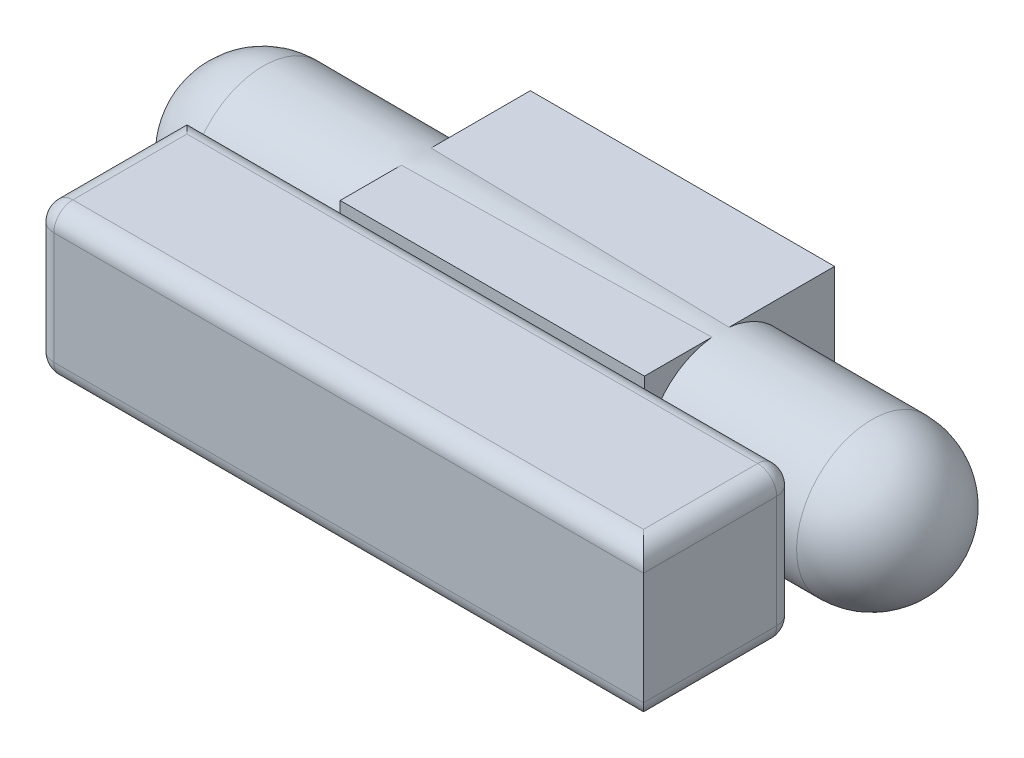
ISO-10303-21;
HEADER;
FILE_DESCRIPTION(('STEP AP214'),'2;1');
FILE_NAME('part.step','',(''),(''),'','','');
FILE_SCHEMA(('AUTOMOTIVE_DESIGN { 1 0 10303 214 1 1 1 1 }'));
ENDSEC;
DATA;
#1=APPLICATION_CONTEXT('core data for automotive mechanical design processes');
#2=APPLICATION_PROTOCOL_DEFINITION('international standard','automotive_design',2000,#1);
#3=PRODUCT_CONTEXT('',#1,'mechanical');
#4=PRODUCT('Part','Part','',(#3));
#5=PRODUCT_RELATED_PRODUCT_CATEGORY('part','',(#4));
#6=PRODUCT_DEFINITION_FORMATION('','',#4);
#7=PRODUCT_DEFINITION_CONTEXT('part definition',#1,'design');
#8=PRODUCT_DEFINITION('design','',#6,#7);
#9=PRODUCT_DEFINITION_SHAPE('','',#8);
#10=(LENGTH_UNIT() NAMED_UNIT(*) SI_UNIT(.MILLI.,.METRE.));
#11=(NAMED_UNIT(*) PLANE_ANGLE_UNIT() SI_UNIT($,.RADIAN.));
#12=(NAMED_UNIT(*) SI_UNIT($,.STERADIAN.) SOLID_ANGLE_UNIT());
#13=UNCERTAINTY_MEASURE_WITH_UNIT(LENGTH_MEASURE(1.E-05),#10,'distance_accuracy_value','');
#14=(GEOMETRIC_REPRESENTATION_CONTEXT(3) GLOBAL_UNCERTAINTY_ASSIGNED_CONTEXT((#13)) GLOBAL_UNIT_ASSIGNED_CONTEXT((#10,
#11,#12)) REPRESENTATION_CONTEXT('',''));
#15=CARTESIAN_POINT('',(0.,0.,0.));
#16=DIRECTION('',(0.,0.,1.));
#17=DIRECTION('',(1.,0.,0.));
#18=AXIS2_PLACEMENT_3D('',#15,#16,#17);
#19=CARTESIAN_POINT('',(76.2302698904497,21.8978765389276,34.925));
#20=DIRECTION('',(-1.,0.,0.));
#21=DIRECTION('',(0.,0.,1.));
#22=AXIS2_PLACEMENT_3D('',#19,#20,#21);
#23=CYLINDRICAL_SURFACE('',#22,3.175);
#24=DIRECTION('',(1.,0.,0.));
#25=VECTOR('',#24,1.);
#26=CARTESIAN_POINT('',(50.8201799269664,21.8978765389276,38.1));
#27=LINE('',#26,#25);
#28=CARTESIAN_POINT('',(101.640359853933,21.8978765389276,38.1));
#29=VERTEX_POINT('',#28);
#30=CARTESIAN_POINT('',(3.175,21.8978765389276,38.1));
#31=VERTEX_POINT('',#30);
#32=EDGE_CURVE('E177',#29,#31,#27,.F.);
#33=ORIENTED_EDGE('',*,*,#32,.F.);
#34=CARTESIAN_POINT('',(98.4653598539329,21.8978765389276,34.925));
#35=DIRECTION('',(-0.707106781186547,0.,0.707106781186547));
#36=DIRECTION('',(0.707106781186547,0.,0.707106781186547));
#37=AXIS2_PLACEMENT_3D('',#34,#35,#36);
#38=ELLIPSE('',#37,4.49012806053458,3.175);
#39=CARTESIAN_POINT('',(98.4653598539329,25.0728765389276,34.925));
#40=VERTEX_POINT('',#39);
#41=EDGE_CURVE('E21',#40,#29,#38,.F.);
#42=ORIENTED_EDGE('',*,*,#41,.F.);
#43=DIRECTION('',(1.,0.,0.));
#44=VECTOR('',#43,1.);
#45=CARTESIAN_POINT('',(101.640359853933,25.0728765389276,34.925));
#46=LINE('',#45,#44);
#47=CARTESIAN_POINT('',(3.175,25.0728765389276,34.925));
#48=VERTEX_POINT('',#47);
#49=EDGE_CURVE('E174',#48,#40,#46,.T.);
#50=ORIENTED_EDGE('',*,*,#49,.F.);
#51=CARTESIAN_POINT('',(3.175,21.8978765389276,34.925));
#52=DIRECTION('',(-1.,0.,0.));
#53=DIRECTION('',(0.,0.,1.));
#54=AXIS2_PLACEMENT_3D('',#51,#52,#53);
#55=CIRCLE('',#54,3.175);
#56=EDGE_CURVE('E550',#31,#48,#55,.T.);
#57=ORIENTED_EDGE('',*,*,#56,.F.);
#58=EDGE_LOOP('',(#33,#42,#50,#57));
#59=FACE_BOUND('',#58,.T.);
#60=ADVANCED_FACE('F17',(#59),#23,.T.);
#61=CARTESIAN_POINT('',(98.4653598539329,21.8978765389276,12.7));
#62=DIRECTION('',(0.,0.,1.));
#63=DIRECTION('',(1.,0.,0.));
#64=AXIS2_PLACEMENT_3D('',#61,#62,#63);
#65=CYLINDRICAL_SURFACE('',#64,3.175);
#66=DIRECTION('',(0.,0.,1.));
#67=VECTOR('',#66,1.);
#68=CARTESIAN_POINT('',(98.4653598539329,25.0728765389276,12.7));
#69=LINE('',#68,#67);
#70=CARTESIAN_POINT('',(98.4653598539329,25.0728765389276,15.875));
#71=VERTEX_POINT('',#70);
#72=EDGE_CURVE('E181',#40,#71,#69,.F.);
#73=ORIENTED_EDGE('',*,*,#72,.F.);
#74=ORIENTED_EDGE('',*,*,#41,.T.);
#75=DIRECTION('',(0.,0.,-1.));
#76=VECTOR('',#75,1.);
#77=CARTESIAN_POINT('',(101.640359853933,21.8978765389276,12.7));
#78=LINE('',#77,#76);
#79=CARTESIAN_POINT('',(101.640359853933,21.8978765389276,15.875));
#80=VERTEX_POINT('',#79);
#81=EDGE_CURVE('E203',#80,#29,#78,.F.);
#82=ORIENTED_EDGE('',*,*,#81,.F.);
#83=CARTESIAN_POINT('',(98.4653598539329,21.8978765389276,15.875));
#84=DIRECTION('',(0.,0.,1.));
#85=DIRECTION('',(1.,0.,0.));
#86=AXIS2_PLACEMENT_3D('',#83,#84,#85);
#87=CIRCLE('',#86,3.175);
#88=EDGE_CURVE('E184',#71,#80,#87,.F.);
#89=ORIENTED_EDGE('',*,*,#88,.F.);
#90=EDGE_LOOP('',(#73,#74,#82,#89));
#91=FACE_BOUND('',#90,.T.);
#92=ADVANCED_FACE('F182',(#91),#65,.T.);
#93=CARTESIAN_POINT('',(50.8201799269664,12.5364382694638,38.1));
#94=DIRECTION('',(0.,0.,1.));
#95=DIRECTION('',(1.,0.,0.));
#96=AXIS2_PLACEMENT_3D('',#93,#94,#95);
#97=PLANE('',#96);
#98=DIRECTION('',(1.,0.,0.));
#99=VECTOR('',#98,1.);
#100=CARTESIAN_POINT('',(25.4100899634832,3.175,38.1));
#101=LINE('',#100,#99);
#102=CARTESIAN_POINT('',(101.640359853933,3.175,38.1));
#103=VERTEX_POINT('',#102);
#104=CARTESIAN_POINT('',(3.175,3.175,38.1));
#105=VERTEX_POINT('',#104);
#106=EDGE_CURVE('E529',#103,#105,#101,.F.);
#107=ORIENTED_EDGE('',*,*,#106,.F.);
#108=DIRECTION('',(0.,1.,0.));
#109=VECTOR('',#108,1.);
#110=CARTESIAN_POINT('',(101.640359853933,0.,38.1));
#111=LINE('',#110,#109);
#112=EDGE_CURVE('E196',#29,#103,#111,.F.);
#113=ORIENTED_EDGE('',*,*,#112,.F.);
#114=ORIENTED_EDGE('',*,*,#32,.T.);
#115=DIRECTION('',(0.,-1.,0.));
#116=VECTOR('',#115,1.);
#117=CARTESIAN_POINT('',(3.175,18.8046574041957,38.1));
#118=LINE('',#117,#116);
#119=EDGE_CURVE('E530',#105,#31,#118,.F.);
#120=ORIENTED_EDGE('',*,*,#119,.F.);
#121=EDGE_LOOP('',(#107,#113,#114,#120));
#122=FACE_BOUND('',#121,.T.);
#123=ADVANCED_FACE('F525',(#122),#97,.T.);
#124=CARTESIAN_POINT('',(3.175,21.8978765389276,34.925));
#125=DIRECTION('',(-0.577350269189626,0.577350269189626,0.577350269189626));
#126=DIRECTION('',(-0.707106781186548,0.,-0.707106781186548));
#127=AXIS2_PLACEMENT_3D('',#124,#125,#126);
#128=SPHERICAL_SURFACE('',#127,3.175);
#129=CARTESIAN_POINT('',(1.34191289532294,23.7309636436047,36.7580871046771));
#130=VERTEX_POINT('',#129);
#131=VERTEX_LOOP('',#130);
#132=FACE_BOUND('',#131,.T.);
#133=CARTESIAN_POINT('',(3.175,21.8978765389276,34.925));
#134=DIRECTION('',(0.,0.,1.));
#135=DIRECTION('',(1.,0.,0.));
#136=AXIS2_PLACEMENT_3D('',#133,#134,#135);
#137=CIRCLE('',#136,3.175);
#138=CARTESIAN_POINT('',(0.,21.8978765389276,34.925));
#139=VERTEX_POINT('',#138);
#140=EDGE_CURVE('E541',#139,#48,#137,.F.);
#141=ORIENTED_EDGE('',*,*,#140,.F.);
#142=CARTESIAN_POINT('',(3.175,21.8978765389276,34.925));
#143=DIRECTION('',(0.,-1.,0.));
#144=DIRECTION('',(0.,0.,-1.));
#145=AXIS2_PLACEMENT_3D('',#142,#143,#144);
#146=CIRCLE('',#145,3.175);
#147=EDGE_CURVE('E532',#31,#139,#146,.T.);
#148=ORIENTED_EDGE('',*,*,#147,.F.);
#149=ORIENTED_EDGE('',*,*,#56,.T.);
#150=EDGE_LOOP('',(#141,#148,#149));
#151=FACE_BOUND('',#150,.T.);
#152=ADVANCED_FACE('F520',(#132,#151),#128,.T.);
#153=CARTESIAN_POINT('',(25.4100899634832,3.175,34.925));
#154=DIRECTION('',(1.,0.,0.));
#155=DIRECTION('',(0.,0.,-1.));
#156=AXIS2_PLACEMENT_3D('',#153,#154,#155);
#157=CYLINDRICAL_SURFACE('',#156,3.175);
#158=DIRECTION('',(1.,0.,0.));
#159=VECTOR('',#158,1.);
#160=CARTESIAN_POINT('',(0.,0.,34.925));
#161=LINE('',#160,#159);
#162=CARTESIAN_POINT('',(98.4653598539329,0.,34.925));
#163=VERTEX_POINT('',#162);
#164=CARTESIAN_POINT('',(3.175,0.,34.925));
#165=VERTEX_POINT('',#164);
#166=EDGE_CURVE('E465',#163,#165,#161,.F.);
#167=ORIENTED_EDGE('',*,*,#166,.F.);
#168=CARTESIAN_POINT('',(98.4653598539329,3.175,34.925));
#169=DIRECTION('',(-0.707106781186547,0.,0.707106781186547));
#170=DIRECTION('',(0.707106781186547,0.,0.707106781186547));
#171=AXIS2_PLACEMENT_3D('',#168,#169,#170);
#172=ELLIPSE('',#171,4.49012806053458,3.175);
#173=EDGE_CURVE('E548',#103,#163,#172,.F.);
#174=ORIENTED_EDGE('',*,*,#173,.F.);
#175=ORIENTED_EDGE('',*,*,#106,.T.);
#176=CARTESIAN_POINT('',(3.175,3.175,34.925));
#177=DIRECTION('',(1.,0.,0.));
#178=DIRECTION('',(0.,0.,-1.));
#179=AXIS2_PLACEMENT_3D('',#176,#177,#178);
#180=CIRCLE('',#179,3.175);
#181=EDGE_CURVE('E500',#165,#105,#180,.F.);
#182=ORIENTED_EDGE('',*,*,#181,.F.);
#183=EDGE_LOOP('',(#167,#174,#175,#182));
#184=FACE_BOUND('',#183,.T.);
#185=ADVANCED_FACE('F516',(#184),#157,.T.);
#186=CARTESIAN_POINT('',(98.4653598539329,3.175,12.7));
#187=DIRECTION('',(0.,0.,1.));
#188=DIRECTION('',(1.,0.,0.));
#189=AXIS2_PLACEMENT_3D('',#186,#187,#188);
#190=CYLINDRICAL_SURFACE('',#189,3.175);
#191=DIRECTION('',(0.,0.,-1.));
#192=VECTOR('',#191,1.);
#193=CARTESIAN_POINT('',(101.640359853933,3.175,12.7));
#194=LINE('',#193,#192);
#195=CARTESIAN_POINT('',(101.640359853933,3.175,15.875));
#196=VERTEX_POINT('',#195);
#197=EDGE_CURVE('E193',#103,#196,#194,.T.);
#198=ORIENTED_EDGE('',*,*,#197,.F.);
#199=ORIENTED_EDGE('',*,*,#173,.T.);
#200=DIRECTION('',(0.,0.,-1.));
#201=VECTOR('',#200,1.);
#202=CARTESIAN_POINT('',(98.4653598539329,0.,12.7));
#203=LINE('',#202,#201);
#204=CARTESIAN_POINT('',(98.4653598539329,0.,15.875));
#205=VERTEX_POINT('',#204);
#206=EDGE_CURVE('E462',#205,#163,#203,.F.);
#207=ORIENTED_EDGE('',*,*,#206,.F.);
#208=CARTESIAN_POINT('',(98.4653598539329,3.175,15.875));
#209=DIRECTION('',(0.,0.,1.));
#210=DIRECTION('',(1.,0.,0.));
#211=AXIS2_PLACEMENT_3D('',#208,#209,#210);
#212=CIRCLE('',#211,3.175);
#213=EDGE_CURVE('E537',#196,#205,#212,.F.);
#214=ORIENTED_EDGE('',*,*,#213,.F.);
#215=EDGE_LOOP('',(#198,#199,#207,#214));
#216=FACE_BOUND('',#215,.T.);
#217=ADVANCED_FACE('F510',(#216),#190,.T.);
#218=CARTESIAN_POINT('',(3.175,3.175,34.925));
#219=DIRECTION('',(-0.577350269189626,-0.577350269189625,0.577350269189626));
#220=DIRECTION('',(-0.707106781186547,0.707106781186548,0.));
#221=AXIS2_PLACEMENT_3D('',#218,#219,#220);
#222=SPHERICAL_SURFACE('',#221,3.175);
#223=CARTESIAN_POINT('',(1.34191289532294,1.34191289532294,36.7580871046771));
#224=VERTEX_POINT('',#223);
#225=VERTEX_LOOP('',#224);
#226=FACE_BOUND('',#225,.T.);
#227=CARTESIAN_POINT('',(3.175,3.175,34.925));
#228=DIRECTION('',(0.,0.,1.));
#229=DIRECTION('',(1.,0.,0.));
#230=AXIS2_PLACEMENT_3D('',#227,#228,#229);
#231=CIRCLE('',#230,3.175);
#232=CARTESIAN_POINT('',(0.,3.175,34.925));
#233=VERTEX_POINT('',#232);
#234=EDGE_CURVE('E461',#165,#233,#231,.F.);
#235=ORIENTED_EDGE('',*,*,#234,.F.);
#236=ORIENTED_EDGE('',*,*,#181,.T.);
#237=CARTESIAN_POINT('',(3.175,3.175,34.925));
#238=DIRECTION('',(0.,-1.,0.));
#239=DIRECTION('',(0.,0.,-1.));
#240=AXIS2_PLACEMENT_3D('',#237,#238,#239);
#241=CIRCLE('',#240,3.175);
#242=EDGE_CURVE('E533',#233,#105,#241,.F.);
#243=ORIENTED_EDGE('',*,*,#242,.F.);
#244=EDGE_LOOP('',(#235,#236,#243));
#245=FACE_BOUND('',#244,.T.);
#246=ADVANCED_FACE('F505',(#226,#245),#222,.T.);
#247=CARTESIAN_POINT('',(35.0667134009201,12.6435695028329,0.));
#248=DIRECTION('',(-0.999998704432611,0.00160969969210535,0.));
#249=DIRECTION('',(-0.00160969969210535,-0.999998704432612,0.));
#250=AXIS2_PLACEMENT_3D('',#247,#248,#249);
#251=CONICAL_SURFACE('',#250,12.6435858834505,0.00160970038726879);
#252=CARTESIAN_POINT('',(38.2760610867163,9.36144052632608,-12.2061862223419));
#253=CARTESIAN_POINT('',(38.1009615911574,9.36165426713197,-12.206461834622));
#254=CARTESIAN_POINT('',(37.9258309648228,9.37639303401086,-12.2106612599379));
#255=CARTESIAN_POINT('',(37.5806552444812,9.43443475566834,-12.2264481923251));
#256=CARTESIAN_POINT('',(37.4106131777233,9.47775437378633,-12.2380400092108));
#257=CARTESIAN_POINT('',(37.080663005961,9.59144412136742,-12.2672659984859));
#258=CARTESIAN_POINT('',(36.9207413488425,9.6617771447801,-12.284891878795));
#259=CARTESIAN_POINT('',(36.6149567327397,9.82737733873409,-12.3242586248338));
#260=CARTESIAN_POINT('',(36.4690944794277,9.92264575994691,-12.3459996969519));
#261=CARTESIAN_POINT('',(36.1921077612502,10.1378181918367,-12.3918066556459));
#262=CARTESIAN_POINT('',(36.061365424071,10.2582057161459,-12.4159123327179));
#263=CARTESIAN_POINT('',(35.8216872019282,10.5191463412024,-12.4635029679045));
#264=CARTESIAN_POINT('',(35.7127536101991,10.6597015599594,-12.486987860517));
#265=CARTESIAN_POINT('',(35.5181281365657,10.9597312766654,-12.5312487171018));
#266=CARTESIAN_POINT('',(35.4328320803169,11.1194703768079,-12.5519758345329));
#267=CARTESIAN_POINT('',(35.2904558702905,11.4516326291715,-12.5880521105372));
#268=CARTESIAN_POINT('',(35.233371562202,11.6240539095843,-12.6034020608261));
#269=CARTESIAN_POINT('',(35.1502114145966,11.9729591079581,-12.6268441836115));
#270=CARTESIAN_POINT('',(35.1235254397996,12.149287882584,-12.6350783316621));
#271=CARTESIAN_POINT('',(35.1000389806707,12.5041022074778,-12.6440075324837));
#272=CARTESIAN_POINT('',(35.1032337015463,12.6825874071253,-12.6447037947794));
#273=CARTESIAN_POINT('',(35.1389761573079,13.0320981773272,-12.6386766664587));
#274=CARTESIAN_POINT('',(35.1708157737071,13.2031999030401,-12.6321313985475));
#275=CARTESIAN_POINT('',(35.2618399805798,13.5375822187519,-12.6127178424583));
#276=CARTESIAN_POINT('',(35.3210257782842,13.7008624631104,-12.5998492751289));
#277=CARTESIAN_POINT('',(35.4654725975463,14.0163892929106,-12.5691329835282));
#278=CARTESIAN_POINT('',(35.5509222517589,14.1685458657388,-12.551249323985));
#279=CARTESIAN_POINT('',(35.7453257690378,14.4566034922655,-12.5125103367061));
#280=CARTESIAN_POINT('',(35.8542836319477,14.5925017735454,-12.4916545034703));
#281=CARTESIAN_POINT('',(36.096073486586,14.8480446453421,-12.4486473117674));
#282=CARTESIAN_POINT('',(36.2294696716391,14.967152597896,-12.426476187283));
#283=CARTESIAN_POINT('',(36.514528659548,15.1814476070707,-12.3838959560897));
#284=CARTESIAN_POINT('',(36.6661924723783,15.2766333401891,-12.3634869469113));
#285=CARTESIAN_POINT('',(36.9847851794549,15.4408754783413,-12.3266947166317));
#286=CARTESIAN_POINT('',(37.1518052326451,15.5097614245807,-12.3103379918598));
#287=CARTESIAN_POINT('',(37.4955468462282,15.6183153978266,-12.2838279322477));
#288=CARTESIAN_POINT('',(37.6722664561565,15.6579892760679,-12.2736733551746));
#289=CARTESIAN_POINT('',(38.0257250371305,15.7061502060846,-12.2609988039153));
#290=CARTESIAN_POINT('',(38.2023560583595,15.7153822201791,-12.2582967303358));
#291=CARTESIAN_POINT('',(38.554649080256,15.7044280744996,-12.2603146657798));
#292=CARTESIAN_POINT('',(38.7303111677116,15.6842445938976,-12.2650339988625));
#293=CARTESIAN_POINT('',(39.072751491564,15.6157131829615,-12.281149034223));
#294=CARTESIAN_POINT('',(39.2396273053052,15.5678246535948,-12.2924358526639));
#295=CARTESIAN_POINT('',(39.5629908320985,15.4457411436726,-12.3202509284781));
#296=CARTESIAN_POINT('',(39.7194773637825,15.3715431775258,-12.3367797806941));
#297=CARTESIAN_POINT('',(40.0207824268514,15.1973781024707,-12.3735248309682));
#298=CARTESIAN_POINT('',(40.1653349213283,15.0969641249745,-12.3938029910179));
#299=CARTESIAN_POINT('',(40.4358243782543,14.8737745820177,-12.4355266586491));
#300=CARTESIAN_POINT('',(40.5617584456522,14.7509955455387,-12.4569723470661));
#301=CARTESIAN_POINT('',(40.7944535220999,14.4831219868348,-12.4991237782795));
#302=CARTESIAN_POINT('',(40.900697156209,14.3375726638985,-12.5198004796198));
#303=CARTESIAN_POINT('',(41.0872359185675,14.0302567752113,-12.5574439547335));
#304=CARTESIAN_POINT('',(41.1675325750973,13.8684911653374,-12.5744109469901));
#305=CARTESIAN_POINT('',(41.2991617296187,13.5345877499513,-12.6024849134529));
#306=CARTESIAN_POINT('',(41.3507212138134,13.3625434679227,-12.6136377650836));
#307=CARTESIAN_POINT('',(41.4241413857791,13.0119368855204,-12.6288958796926));
#308=CARTESIAN_POINT('',(41.4460076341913,12.8333758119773,-12.633002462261));
#309=CARTESIAN_POINT('',(41.459138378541,12.4798202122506,-12.6335681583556));
#310=CARTESIAN_POINT('',(41.451189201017,12.3048547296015,-12.6302247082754));
#311=CARTESIAN_POINT('',(41.4067412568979,11.9588798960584,-12.6165492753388));
#312=CARTESIAN_POINT('',(41.3702430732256,11.787870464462,-12.6062174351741));
#313=CARTESIAN_POINT('',(41.2701016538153,11.4552026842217,-12.579626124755));
#314=CARTESIAN_POINT('',(41.2065595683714,11.2935120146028,-12.5633887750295));
#315=CARTESIAN_POINT('',(41.0542664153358,10.9830119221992,-12.5265920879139));
#316=CARTESIAN_POINT('',(40.9655119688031,10.834204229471,-12.506032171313));
#317=CARTESIAN_POINT('',(40.7627030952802,10.5496476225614,-12.4620819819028));
#318=CARTESIAN_POINT('',(40.6480689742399,10.4143208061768,-12.4386335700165));
#319=CARTESIAN_POINT('',(40.3978792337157,10.16455770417,-12.3917874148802));
#320=CARTESIAN_POINT('',(40.2623182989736,10.0501267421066,-12.3683896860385));
#321=CARTESIAN_POINT('',(39.9711296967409,9.84336393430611,-12.3237574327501));
#322=CARTESIAN_POINT('',(39.8151815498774,9.75147248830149,-12.3025700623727));
#323=CARTESIAN_POINT('',(39.4895073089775,9.59536700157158,-12.2653353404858));
#324=CARTESIAN_POINT('',(39.3197915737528,9.53113237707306,-12.2492841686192));
#325=CARTESIAN_POINT('',(39.0046354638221,9.44179445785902,-12.2266395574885));
#326=CARTESIAN_POINT('',(38.8607120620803,9.41157414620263,-12.2188283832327));
#327=CARTESIAN_POINT('',(38.5698865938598,9.37130842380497,-12.2084863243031));
#328=CARTESIAN_POINT('',(38.4229847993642,9.36126117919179,-12.2059549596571));
#329=CARTESIAN_POINT('',(38.2760610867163,9.36144052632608,-12.2061862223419));
#330=B_SPLINE_CURVE_WITH_KNOTS('',3,(#252,#253,#254,#255,#256,#257,#258,#259,#260,#261,#262,
#263,#264,#265,#266,#267,#268,#269,#270,#271,#272,#273,#274,#275,#276,#277,#278,#279,#280,#281,
#282,#283,#284,#285,#286,#287,#288,#289,#290,#291,#292,#293,#294,#295,#296,#297,#298,#299,#300,
#301,#302,#303,#304,#305,#306,#307,#308,#309,#310,#311,#312,#313,#314,#315,#316,#317,#318,#319,
#320,#321,#322,#323,#324,#325,#326,#327,#328,#329),.UNSPECIFIED.,.T.,.F.,(4,2,2,2,2,2,2,2,2,2,2,
2,2,2,2,2,2,2,2,2,2,2,2,2,2,2,2,2,2,2,2,2,2,2,2,2,2,2,4),(0.,0.524758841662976,1.04982390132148,
1.57417028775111,2.09854297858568,2.63413574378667,3.16978479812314,3.7139254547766,
4.25798596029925,4.79092261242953,5.32377374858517,5.8438038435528,6.36385689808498,
6.88773599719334,7.41170430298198,7.94979128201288,8.48790802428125,9.02945557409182,
9.57089462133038,10.0989813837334,10.6270200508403,11.1465440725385,11.6661270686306,
12.1952216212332,12.7243983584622,13.265952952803,13.8074756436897,14.3446580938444,
14.8817399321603,15.4047580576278,15.9277655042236,16.4488337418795,16.9699718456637,
17.5042050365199,18.0385741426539,18.5826747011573,19.1263696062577,19.5667279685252,
20.0070462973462),.UNSPECIFIED.);
#331=CARTESIAN_POINT('',(38.2760610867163,9.36144052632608,-12.2061862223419));
#332=VERTEX_POINT('',#331);
#333=EDGE_CURVE('E600',#332,#332,#330,.T.);
#334=ORIENTED_EDGE('',*,*,#333,.T.);
#335=EDGE_LOOP('',(#334));
#336=FACE_BOUND('',#335,.T.);
#337=ADVANCED_FACE('F509',(#336),#251,.T.);
#338=CARTESIAN_POINT('',(60.4666916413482,12.6026831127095,0.));
#339=DIRECTION('',(-0.999998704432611,0.00160969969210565,0.));
#340=DIRECTION('',(-0.00160969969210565,-0.999998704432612,0.));
#341=AXIS2_PLACEMENT_3D('',#338,#339,#340);
#342=CONICAL_SURFACE('',#341,12.6026994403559,0.00160970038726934);
#343=CARTESIAN_POINT('',(63.6760488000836,9.36144054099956,-12.1747883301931));
#344=CARTESIAN_POINT('',(63.5008734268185,9.36165501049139,-12.1750642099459));
#345=CARTESIAN_POINT('',(63.3256674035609,9.37640696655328,-12.1792285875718));
#346=CARTESIAN_POINT('',(62.9803415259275,9.43450111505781,-12.1948753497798));
#347=CARTESIAN_POINT('',(62.8102246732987,9.47785984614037,-12.2063619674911));
#348=CARTESIAN_POINT('',(62.4801248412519,9.59165798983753,-12.2353095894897));
#349=CARTESIAN_POINT('',(62.3201284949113,9.66206077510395,-12.2527625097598));
#350=CARTESIAN_POINT('',(62.0142050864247,9.82783290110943,-12.2917164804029));
#351=CARTESIAN_POINT('',(61.8682787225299,9.92320348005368,-12.3132177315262));
#352=CARTESIAN_POINT('',(61.5912325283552,10.1385761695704,-12.3584643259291));
#353=CARTESIAN_POINT('',(61.4604889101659,10.2590543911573,-12.3822473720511));
#354=CARTESIAN_POINT('',(61.2208275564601,10.5201886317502,-12.429123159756));
#355=CARTESIAN_POINT('',(61.1119120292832,10.660846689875,-12.4522158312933));
#356=CARTESIAN_POINT('',(60.9174149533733,10.9609864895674,-12.4956038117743));
#357=CARTESIAN_POINT('',(60.8322129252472,11.1207216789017,-12.5158513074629));
#358=CARTESIAN_POINT('',(60.690018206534,11.452848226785,-12.5509127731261));
#359=CARTESIAN_POINT('',(60.6330212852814,11.6252376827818,-12.5657275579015));
#360=CARTESIAN_POINT('',(60.5500310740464,11.973997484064,-12.5880657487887));
#361=CARTESIAN_POINT('',(60.5234199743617,12.1502113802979,-12.5957338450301));
#362=CARTESIAN_POINT('',(60.5000398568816,12.5047614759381,-12.6035117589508));
#363=CARTESIAN_POINT('',(60.5032661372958,12.6830973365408,-12.603622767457));
#364=CARTESIAN_POINT('',(60.5390227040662,13.0323647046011,-12.5964368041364));
#365=CARTESIAN_POINT('',(60.5708584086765,13.2033715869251,-12.5893149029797));
#366=CARTESIAN_POINT('',(60.6618360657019,13.5375527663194,-12.5687580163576));
#367=CARTESIAN_POINT('',(60.7209793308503,13.7007266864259,-12.5553227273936));
#368=CARTESIAN_POINT('',(60.8653546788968,14.0161662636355,-12.5234820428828));
#369=CARTESIAN_POINT('',(60.950794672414,14.1683326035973,-12.5050371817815));
#370=CARTESIAN_POINT('',(61.145177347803,14.4564077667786,-12.4652121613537));
#371=CARTESIAN_POINT('',(61.2541241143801,14.5923137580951,-12.4438314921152));
#372=CARTESIAN_POINT('',(61.4959509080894,14.847935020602,-12.399806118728));
#373=CARTESIAN_POINT('',(61.6294048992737,14.9671046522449,-12.3771428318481));
#374=CARTESIAN_POINT('',(61.9146095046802,15.181507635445,-12.3336598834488));
#375=CARTESIAN_POINT('',(62.0663611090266,15.2767396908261,-12.3128403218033));
#376=CARTESIAN_POINT('',(62.3851044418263,15.4410205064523,-12.2753383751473));
#377=CARTESIAN_POINT('',(62.5521823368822,15.5099083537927,-12.2586816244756));
#378=CARTESIAN_POINT('',(62.8960583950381,15.6184490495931,-12.2316984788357));
#379=CARTESIAN_POINT('',(63.0728545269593,15.6581079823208,-12.2213707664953));
#380=CARTESIAN_POINT('',(63.4263002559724,15.7061908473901,-12.2084999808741));
#381=CARTESIAN_POINT('',(63.6028376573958,15.7153886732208,-12.2057643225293));
#382=CARTESIAN_POINT('',(63.9549386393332,15.7043976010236,-12.2078374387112));
#383=CARTESIAN_POINT('',(64.1305023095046,15.6842114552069,-12.2126455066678));
#384=CARTESIAN_POINT('',(64.4726607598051,15.6157263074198,-12.2290476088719));
#385=CARTESIAN_POINT('',(64.6393560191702,15.5678993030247,-12.2405277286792));
#386=CARTESIAN_POINT('',(64.9623701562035,15.4460031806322,-12.2688252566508));
#387=CARTESIAN_POINT('',(65.1186878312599,15.3719310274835,-12.2856432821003));
#388=CARTESIAN_POINT('',(65.4197630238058,15.1980367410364,-12.3230677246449));
#389=CARTESIAN_POINT('',(65.5642470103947,15.0977554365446,-12.3437395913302));
#390=CARTESIAN_POINT('',(65.8346296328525,14.8748659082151,-12.3863278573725));
#391=CARTESIAN_POINT('',(65.96052528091,14.7522541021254,-12.4082444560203));
#392=CARTESIAN_POINT('',(66.1932972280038,14.4846162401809,-12.4514328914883));
#393=CARTESIAN_POINT('',(66.2996361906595,14.3391173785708,-12.4726760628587));
#394=CARTESIAN_POINT('',(66.4863742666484,14.0318773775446,-12.5114944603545));
#395=CARTESIAN_POINT('',(66.5667748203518,13.8701371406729,-12.529069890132));
#396=CARTESIAN_POINT('',(66.6986391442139,13.5361847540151,-12.558380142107));
#397=CARTESIAN_POINT('',(66.7503193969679,13.3640620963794,-12.5701585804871));
#398=CARTESIAN_POINT('',(66.8239489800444,13.0132524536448,-12.5866570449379));
#399=CARTESIAN_POINT('',(66.8459039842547,12.8345667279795,-12.591378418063));
#400=CARTESIAN_POINT('',(66.8591588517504,12.480817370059,-12.5931241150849));
#401=CARTESIAN_POINT('',(66.8512611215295,12.3057843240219,-12.5903504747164));
#402=CARTESIAN_POINT('',(66.8068873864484,11.9596493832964,-12.5777737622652));
#403=CARTESIAN_POINT('',(66.7704120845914,11.7885473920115,-12.5679708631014));
#404=CARTESIAN_POINT('',(66.6703201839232,11.4558140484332,-12.5423932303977));
#405=CARTESIAN_POINT('',(66.6068258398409,11.2941437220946,-12.5266454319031));
#406=CARTESIAN_POINT('',(66.4546319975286,10.9836687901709,-12.4907757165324));
#407=CARTESIAN_POINT('',(66.3659291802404,10.8348658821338,-12.4706532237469));
#408=CARTESIAN_POINT('',(66.1632651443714,10.5503584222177,-12.427536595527));
#409=CARTESIAN_POINT('',(66.0487325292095,10.4150697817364,-12.4044836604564));
#410=CARTESIAN_POINT('',(65.7987685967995,10.1653595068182,-12.358359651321));
#411=CARTESIAN_POINT('',(65.663331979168,10.0509431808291,-12.3352885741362));
#412=CARTESIAN_POINT('',(65.3723736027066,9.84414951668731,-12.2912307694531));
#413=CARTESIAN_POINT('',(65.2165264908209,9.75221928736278,-12.2702905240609));
#414=CARTESIAN_POINT('',(64.8910636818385,9.59601196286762,-12.2334636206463));
#415=CARTESIAN_POINT('',(64.7214581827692,9.53171460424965,-12.2175732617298));
#416=CARTESIAN_POINT('',(64.4061340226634,9.44213101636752,-12.1951106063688));
#417=CARTESIAN_POINT('',(64.2619173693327,9.41178389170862,-12.1873482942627));
#418=CARTESIAN_POINT('',(63.9704904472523,9.37134943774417,-12.1770714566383));
#419=CARTESIAN_POINT('',(63.8232804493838,9.36126028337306,-12.1745564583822));
#420=CARTESIAN_POINT('',(63.6760488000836,9.36144054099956,-12.1747883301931));
#421=B_SPLINE_CURVE_WITH_KNOTS('',3,(#343,#344,#345,#346,#347,#348,#349,#350,#351,#352,#353,
#354,#355,#356,#357,#358,#359,#360,#361,#362,#363,#364,#365,#366,#367,#368,#369,#370,#371,#372,
#373,#374,#375,#376,#377,#378,#379,#380,#381,#382,#383,#384,#385,#386,#387,#388,#389,#390,#391,
#392,#393,#394,#395,#396,#397,#398,#399,#400,#401,#402,#403,#404,#405,#406,#407,#408,#409,#410,
#411,#412,#413,#414,#415,#416,#417,#418,#419,#420),.UNSPECIFIED.,.T.,.F.,(4,2,2,2,2,2,2,2,2,2,2,
2,2,2,2,2,2,2,2,2,2,2,2,2,2,2,2,2,2,2,2,2,2,2,2,2,2,2,4),(0.,0.52498564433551,1.0502750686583,
1.57485555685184,2.09946206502,2.63510839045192,3.17080887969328,3.71464558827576,
4.25840069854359,4.79089139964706,5.32329819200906,5.84311830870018,6.36296341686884,
6.88702902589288,7.41118577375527,7.94970399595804,8.48825137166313,9.03003761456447,
9.57171104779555,10.0995126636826,10.6272648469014,11.1462607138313,11.6653166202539,
12.1941590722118,12.7230864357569,13.2648841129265,13.8066516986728,14.3442782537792,
14.8818021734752,15.4049821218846,15.9281492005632,16.4489738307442,16.9698670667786,
17.5036670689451,18.0376026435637,18.5814206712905,19.1248392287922,19.5661196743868,
20.007360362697),.UNSPECIFIED.);
#422=CARTESIAN_POINT('',(63.6760488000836,9.36144054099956,-12.1747883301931));
#423=VERTEX_POINT('',#422);
#424=EDGE_CURVE('E594',#423,#423,#421,.T.);
#425=ORIENTED_EDGE('',*,*,#424,.T.);
#426=EDGE_LOOP('',(#425));
#427=FACE_BOUND('',#426,.T.);
#428=ADVANCED_FACE('F605',(#427),#342,.T.);
#429=CARTESIAN_POINT('',(101.640359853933,0.,12.7));
#430=DIRECTION('',(1.,0.,0.));
#431=DIRECTION('',(0.,0.,-1.));
#432=AXIS2_PLACEMENT_3D('',#429,#430,#431);
#433=PLANE('',#432);
#434=ORIENTED_EDGE('',*,*,#197,.T.);
#435=DIRECTION('',(0.,1.,0.));
#436=VECTOR('',#435,1.);
#437=CARTESIAN_POINT('',(101.640359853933,6.26821913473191,15.875));
#438=LINE('',#437,#436);
#439=EDGE_CURVE('E493',#80,#196,#438,.F.);
#440=ORIENTED_EDGE('',*,*,#439,.F.);
#441=ORIENTED_EDGE('',*,*,#81,.T.);
#442=ORIENTED_EDGE('',*,*,#112,.T.);
#443=EDGE_LOOP('',(#434,#440,#441,#442));
#444=FACE_BOUND('',#443,.T.);
#445=ADVANCED_FACE('F608',(#444),#433,.T.);
#446=CARTESIAN_POINT('',(101.640359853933,25.0728765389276,12.7));
#447=DIRECTION('',(0.,1.,0.));
#448=DIRECTION('',(0.,0.,1.));
#449=AXIS2_PLACEMENT_3D('',#446,#447,#448);
#450=PLANE('',#449);
#451=ORIENTED_EDGE('',*,*,#49,.T.);
#452=ORIENTED_EDGE('',*,*,#72,.T.);
#453=DIRECTION('',(-1.,0.,0.));
#454=VECTOR('',#453,1.);
#455=CARTESIAN_POINT('',(76.2302698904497,25.0728765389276,15.875));
#456=LINE('',#455,#454);
#457=CARTESIAN_POINT('',(3.175,25.0728765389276,15.875));
#458=VERTEX_POINT('',#457);
#459=EDGE_CURVE('E452',#458,#71,#456,.F.);
#460=ORIENTED_EDGE('',*,*,#459,.F.);
#461=DIRECTION('',(0.,0.,1.));
#462=VECTOR('',#461,1.);
#463=CARTESIAN_POINT('',(3.175,25.0728765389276,12.7));
#464=LINE('',#463,#462);
#465=EDGE_CURVE('E191',#48,#458,#464,.F.);
#466=ORIENTED_EDGE('',*,*,#465,.F.);
#467=EDGE_LOOP('',(#451,#452,#460,#466));
#468=FACE_BOUND('',#467,.T.);
#469=ADVANCED_FACE('F190',(#468),#450,.T.);
#470=CARTESIAN_POINT('',(98.4653598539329,21.8978765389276,15.875));
#471=DIRECTION('',(0.577350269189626,0.577350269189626,-0.577350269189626));
#472=DIRECTION('',(0.707106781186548,0.,0.707106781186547));
#473=AXIS2_PLACEMENT_3D('',#470,#471,#472);
#474=SPHERICAL_SURFACE('',#473,3.175);
#475=CARTESIAN_POINT('',(100.29844695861,23.7309636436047,14.0419128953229));
#476=VERTEX_POINT('',#475);
#477=VERTEX_LOOP('',#476);
#478=FACE_BOUND('',#477,.T.);
#479=CARTESIAN_POINT('',(98.4653598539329,21.8978765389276,15.875));
#480=DIRECTION('',(0.,1.,0.));
#481=DIRECTION('',(0.,0.,1.));
#482=AXIS2_PLACEMENT_3D('',#479,#480,#481);
#483=CIRCLE('',#482,3.175);
#484=CARTESIAN_POINT('',(98.4653598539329,21.8978765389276,12.7));
#485=VERTEX_POINT('',#484);
#486=EDGE_CURVE('E496',#485,#80,#483,.F.);
#487=ORIENTED_EDGE('',*,*,#486,.F.);
#488=CARTESIAN_POINT('',(98.4653598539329,21.8978765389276,15.875));
#489=DIRECTION('',(-1.,0.,0.));
#490=DIRECTION('',(0.,0.,1.));
#491=AXIS2_PLACEMENT_3D('',#488,#489,#490);
#492=CIRCLE('',#491,3.175);
#493=EDGE_CURVE('E451',#71,#485,#492,.T.);
#494=ORIENTED_EDGE('',*,*,#493,.F.);
#495=ORIENTED_EDGE('',*,*,#88,.T.);
#496=EDGE_LOOP('',(#487,#494,#495));
#497=FACE_BOUND('',#496,.T.);
#498=ADVANCED_FACE('F484',(#478,#497),#474,.T.);
#499=CARTESIAN_POINT('',(3.175,21.8978765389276,12.7));
#500=DIRECTION('',(0.,0.,1.));
#501=DIRECTION('',(1.,0.,0.));
#502=AXIS2_PLACEMENT_3D('',#499,#500,#501);
#503=CYLINDRICAL_SURFACE('',#502,3.175);
#504=ORIENTED_EDGE('',*,*,#465,.T.);
#505=CARTESIAN_POINT('',(3.175,21.8978765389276,15.875));
#506=DIRECTION('',(-0.707106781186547,0.,0.707106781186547));
#507=DIRECTION('',(-0.707106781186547,0.,-0.707106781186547));
#508=AXIS2_PLACEMENT_3D('',#505,#506,#507);
#509=ELLIPSE('',#508,4.49012806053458,3.175);
#510=CARTESIAN_POINT('',(0.,21.8978765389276,12.7));
#511=VERTEX_POINT('',#510);
#512=EDGE_CURVE('E455',#511,#458,#509,.F.);
#513=ORIENTED_EDGE('',*,*,#512,.F.);
#514=DIRECTION('',(0.,0.,1.));
#515=VECTOR('',#514,1.);
#516=CARTESIAN_POINT('',(0.,21.8978765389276,12.7));
#517=LINE('',#516,#515);
#518=EDGE_CURVE('E448',#139,#511,#517,.F.);
#519=ORIENTED_EDGE('',*,*,#518,.F.);
#520=ORIENTED_EDGE('',*,*,#140,.T.);
#521=EDGE_LOOP('',(#504,#513,#519,#520));
#522=FACE_BOUND('',#521,.T.);
#523=ADVANCED_FACE('F480',(#522),#503,.T.);
#524=CARTESIAN_POINT('',(3.175,18.8046574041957,34.925));
#525=DIRECTION('',(0.,-1.,0.));
#526=DIRECTION('',(0.,0.,-1.));
#527=AXIS2_PLACEMENT_3D('',#524,#525,#526);
#528=CYLINDRICAL_SURFACE('',#527,3.175);
#529=ORIENTED_EDGE('',*,*,#147,.T.);
#530=DIRECTION('',(0.,1.,0.));
#531=VECTOR('',#530,1.);
#532=CARTESIAN_POINT('',(0.,25.0728765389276,34.925));
#533=LINE('',#532,#531);
#534=EDGE_CURVE('E447',#233,#139,#533,.T.);
#535=ORIENTED_EDGE('',*,*,#534,.F.);
#536=ORIENTED_EDGE('',*,*,#242,.T.);
#537=ORIENTED_EDGE('',*,*,#119,.T.);
#538=EDGE_LOOP('',(#529,#535,#536,#537));
#539=FACE_BOUND('',#538,.T.);
#540=ADVANCED_FACE('F475',(#539),#528,.T.);
#541=CARTESIAN_POINT('',(98.4653598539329,3.175,15.875));
#542=DIRECTION('',(0.577350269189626,-0.577350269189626,-0.577350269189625));
#543=DIRECTION('',(-0.707106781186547,-0.707106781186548,0.));
#544=AXIS2_PLACEMENT_3D('',#541,#542,#543);
#545=SPHERICAL_SURFACE('',#544,3.175);
#546=CARTESIAN_POINT('',(100.29844695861,1.34191289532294,14.0419128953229));
#547=VERTEX_POINT('',#546);
#548=VERTEX_LOOP('',#547);
#549=FACE_BOUND('',#548,.T.);
#550=CARTESIAN_POINT('',(98.4653598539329,3.175,15.875));
#551=DIRECTION('',(1.,0.,0.));
#552=DIRECTION('',(0.,0.,-1.));
#553=AXIS2_PLACEMENT_3D('',#550,#551,#552);
#554=CIRCLE('',#553,3.175);
#555=CARTESIAN_POINT('',(98.4653598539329,3.175,12.7));
#556=VERTEX_POINT('',#555);
#557=EDGE_CURVE('E443',#556,#205,#554,.F.);
#558=ORIENTED_EDGE('',*,*,#557,.F.);
#559=CARTESIAN_POINT('',(98.4653598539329,3.175,15.875));
#560=DIRECTION('',(0.,1.,0.));
#561=DIRECTION('',(0.,0.,1.));
#562=AXIS2_PLACEMENT_3D('',#559,#560,#561);
#563=CIRCLE('',#562,3.175);
#564=EDGE_CURVE('E495',#196,#556,#563,.T.);
#565=ORIENTED_EDGE('',*,*,#564,.F.);
#566=ORIENTED_EDGE('',*,*,#213,.T.);
#567=EDGE_LOOP('',(#558,#565,#566));
#568=FACE_BOUND('',#567,.T.);
#569=ADVANCED_FACE('F470',(#549,#568),#545,.T.);
#570=CARTESIAN_POINT('',(0.,0.,12.7));
#571=DIRECTION('',(0.,-1.,0.));
#572=DIRECTION('',(0.,0.,-1.));
#573=AXIS2_PLACEMENT_3D('',#570,#571,#572);
#574=PLANE('',#573);
#575=DIRECTION('',(1.,0.,0.));
#576=VECTOR('',#575,1.);
#577=CARTESIAN_POINT('',(25.4100899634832,0.,15.875));
#578=LINE('',#577,#576);
#579=CARTESIAN_POINT('',(3.175,0.,15.875));
#580=VERTEX_POINT('',#579);
#581=EDGE_CURVE('E439',#205,#580,#578,.F.);
#582=ORIENTED_EDGE('',*,*,#581,.F.);
#583=ORIENTED_EDGE('',*,*,#206,.T.);
#584=ORIENTED_EDGE('',*,*,#166,.T.);
#585=DIRECTION('',(0.,0.,1.));
#586=VECTOR('',#585,1.);
#587=CARTESIAN_POINT('',(3.175,0.,12.7));
#588=LINE('',#587,#586);
#589=EDGE_CURVE('E458',#580,#165,#588,.T.);
#590=ORIENTED_EDGE('',*,*,#589,.F.);
#591=EDGE_LOOP('',(#582,#583,#584,#590));
#592=FACE_BOUND('',#591,.T.);
#593=ADVANCED_FACE('F474',(#592),#574,.T.);
#594=CARTESIAN_POINT('',(3.175,3.175,12.7));
#595=DIRECTION('',(0.,0.,1.));
#596=DIRECTION('',(1.,0.,0.));
#597=AXIS2_PLACEMENT_3D('',#594,#595,#596);
#598=CYLINDRICAL_SURFACE('',#597,3.175);
#599=DIRECTION('',(0.,0.,1.));
#600=VECTOR('',#599,1.);
#601=CARTESIAN_POINT('',(0.,3.175,12.7));
#602=LINE('',#601,#600);
#603=CARTESIAN_POINT('',(0.,3.175,12.7));
#604=VERTEX_POINT('',#603);
#605=EDGE_CURVE('E444',#604,#233,#602,.T.);
#606=ORIENTED_EDGE('',*,*,#605,.F.);
#607=CARTESIAN_POINT('',(3.175,3.175,15.875));
#608=DIRECTION('',(0.707106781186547,0.,-0.707106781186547));
#609=DIRECTION('',(0.707106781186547,0.,0.707106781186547));
#610=AXIS2_PLACEMENT_3D('',#607,#608,#609);
#611=ELLIPSE('',#610,4.49012806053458,3.175);
#612=EDGE_CURVE('E442',#580,#604,#611,.T.);
#613=ORIENTED_EDGE('',*,*,#612,.F.);
#614=ORIENTED_EDGE('',*,*,#589,.T.);
#615=ORIENTED_EDGE('',*,*,#234,.T.);
#616=EDGE_LOOP('',(#606,#613,#614,#615));
#617=FACE_BOUND('',#616,.T.);
#618=ADVANCED_FACE('F669',(#617),#598,.T.);
#619=CARTESIAN_POINT('',(38.2798467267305,12.5364382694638,-19.05));
#620=DIRECTION('',(0.,0.,1.));
#621=DIRECTION('',(1.,0.,0.));
#622=AXIS2_PLACEMENT_3D('',#619,#620,#621);
#623=CYLINDRICAL_SURFACE('',#622,3.175);
#624=ORIENTED_EDGE('',*,*,#333,.F.);
#625=EDGE_LOOP('',(#624));
#626=FACE_BOUND('',#625,.T.);
#627=CARTESIAN_POINT('',(38.2798467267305,12.5364382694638,-19.05));
#628=DIRECTION('',(0.,0.,1.));
#629=DIRECTION('',(1.,0.,0.));
#630=AXIS2_PLACEMENT_3D('',#627,#628,#629);
#631=CIRCLE('',#630,3.175);
#632=CARTESIAN_POINT('',(41.4548467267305,12.5364382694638,-19.05));
#633=VERTEX_POINT('',#632);
#634=EDGE_CURVE('E663',#633,#633,#631,.F.);
#635=ORIENTED_EDGE('',*,*,#634,.T.);
#636=EDGE_LOOP('',(#635));
#637=FACE_BOUND('',#636,.T.);
#638=ADVANCED_FACE('F590',(#626,#637),#623,.F.);
#639=CARTESIAN_POINT('',(63.6798467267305,12.5364382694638,-19.05));
#640=DIRECTION('',(0.,0.,1.));
#641=DIRECTION('',(1.,0.,0.));
#642=AXIS2_PLACEMENT_3D('',#639,#640,#641);
#643=CYLINDRICAL_SURFACE('',#642,3.175);
#644=ORIENTED_EDGE('',*,*,#424,.F.);
#645=EDGE_LOOP('',(#644));
#646=FACE_BOUND('',#645,.T.);
#647=CARTESIAN_POINT('',(63.6798467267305,12.5364382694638,-19.05));
#648=DIRECTION('',(0.,0.,1.));
#649=DIRECTION('',(1.,0.,0.));
#650=AXIS2_PLACEMENT_3D('',#647,#648,#649);
#651=CIRCLE('',#650,3.175);
#652=CARTESIAN_POINT('',(66.8548467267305,12.5364382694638,-19.05));
#653=VERTEX_POINT('',#652);
#654=EDGE_CURVE('E401',#653,#653,#651,.F.);
#655=ORIENTED_EDGE('',*,*,#654,.T.);
#656=EDGE_LOOP('',(#655));
#657=FACE_BOUND('',#656,.T.);
#658=ADVANCED_FACE('F585',(#646,#657),#643,.F.);
#659=CARTESIAN_POINT('',(98.4653598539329,6.26821913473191,15.875));
#660=DIRECTION('',(0.,1.,0.));
#661=DIRECTION('',(0.,0.,1.));
#662=AXIS2_PLACEMENT_3D('',#659,#660,#661);
#663=CYLINDRICAL_SURFACE('',#662,3.175);
#664=ORIENTED_EDGE('',*,*,#564,.T.);
#665=DIRECTION('',(0.,1.,0.));
#666=VECTOR('',#665,1.);
#667=CARTESIAN_POINT('',(98.4653598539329,12.5364382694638,12.7));
#668=LINE('',#667,#666);
#669=EDGE_CURVE('E388',#556,#485,#668,.T.);
#670=ORIENTED_EDGE('',*,*,#669,.T.);
#671=ORIENTED_EDGE('',*,*,#486,.T.);
#672=ORIENTED_EDGE('',*,*,#439,.T.);
#673=EDGE_LOOP('',(#664,#670,#671,#672));
#674=FACE_BOUND('',#673,.T.);
#675=ADVANCED_FACE('F581',(#674),#663,.T.);
#676=CARTESIAN_POINT('',(76.2302698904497,21.8978765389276,15.875));
#677=DIRECTION('',(-1.,0.,0.));
#678=DIRECTION('',(0.,0.,1.));
#679=AXIS2_PLACEMENT_3D('',#676,#677,#678);
#680=CYLINDRICAL_SURFACE('',#679,3.175);
#681=ORIENTED_EDGE('',*,*,#493,.T.);
#682=DIRECTION('',(1.,0.,0.));
#683=VECTOR('',#682,1.);
#684=CARTESIAN_POINT('',(50.8201799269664,21.8978765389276,12.7));
#685=LINE('',#684,#683);
#686=CARTESIAN_POINT('',(76.3798468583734,21.8978765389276,12.7));
#687=VERTEX_POINT('',#686);
#688=EDGE_CURVE('E380',#485,#687,#685,.F.);
#689=ORIENTED_EDGE('',*,*,#688,.T.);
#690=DIRECTION('',(1.,0.,0.));
#691=VECTOR('',#690,1.);
#692=CARTESIAN_POINT('',(50.9798468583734,21.8978765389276,12.7));
#693=LINE('',#692,#691);
#694=CARTESIAN_POINT('',(25.5798468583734,21.8978765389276,12.7));
#695=VERTEX_POINT('',#694);
#696=EDGE_CURVE('E389',#695,#687,#693,.T.);
#697=ORIENTED_EDGE('',*,*,#696,.F.);
#698=DIRECTION('',(1.,0.,0.));
#699=VECTOR('',#698,1.);
#700=CARTESIAN_POINT('',(50.8201799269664,21.8978765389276,12.7));
#701=LINE('',#700,#699);
#702=EDGE_CURVE('E415',#695,#511,#701,.F.);
#703=ORIENTED_EDGE('',*,*,#702,.T.);
#704=ORIENTED_EDGE('',*,*,#512,.T.);
#705=ORIENTED_EDGE('',*,*,#459,.T.);
#706=EDGE_LOOP('',(#681,#689,#697,#703,#704,#705));
#707=FACE_BOUND('',#706,.T.);
#708=ADVANCED_FACE('F577',(#707),#680,.T.);
#709=CARTESIAN_POINT('',(0.,25.0728765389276,12.7));
#710=DIRECTION('',(-1.,0.,0.));
#711=DIRECTION('',(0.,0.,1.));
#712=AXIS2_PLACEMENT_3D('',#709,#710,#711);
#713=PLANE('',#712);
#714=ORIENTED_EDGE('',*,*,#605,.T.);
#715=ORIENTED_EDGE('',*,*,#534,.T.);
#716=ORIENTED_EDGE('',*,*,#518,.T.);
#717=DIRECTION('',(0.,1.,0.));
#718=VECTOR('',#717,1.);
#719=CARTESIAN_POINT('',(0.,12.5364382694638,12.7));
#720=LINE('',#719,#718);
#721=CARTESIAN_POINT('',(0.,12.720459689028,12.6999999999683));
#722=VERTEX_POINT('',#721);
#723=EDGE_CURVE('E418',#511,#722,#720,.F.);
#724=ORIENTED_EDGE('',*,*,#723,.T.);
#725=CARTESIAN_POINT('',(0.,12.7204596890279,12.6999999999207));
#726=CARTESIAN_POINT('',(0.,12.7068308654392,12.6999999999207));
#727=CARTESIAN_POINT('',(0.,12.6932020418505,12.6999999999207));
#728=CARTESIAN_POINT('',(0.,12.6795732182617,12.6999999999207));
#729=B_SPLINE_CURVE_WITH_KNOTS('',3,(#725,#726,#727,#728),.UNSPECIFIED.,.F.,.F.,(4,4),(0.,
0.0408864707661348),.UNSPECIFIED.);
#730=CARTESIAN_POINT('',(0.,12.6795732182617,12.6999999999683));
#731=VERTEX_POINT('',#730);
#732=EDGE_CURVE('E290',#722,#731,#729,.T.);
#733=ORIENTED_EDGE('',*,*,#732,.T.);
#734=DIRECTION('',(0.,1.,0.));
#735=VECTOR('',#734,1.);
#736=CARTESIAN_POINT('',(0.,12.5364382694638,12.7));
#737=LINE('',#736,#735);
#738=EDGE_CURVE('E285',#731,#604,#737,.F.);
#739=ORIENTED_EDGE('',*,*,#738,.T.);
#740=EDGE_LOOP('',(#714,#715,#716,#724,#733,#739));
#741=FACE_BOUND('',#740,.T.);
#742=ADVANCED_FACE('F557',(#741),#713,.T.);
#743=CARTESIAN_POINT('',(25.4100899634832,3.175,15.875));
#744=DIRECTION('',(1.,0.,0.));
#745=DIRECTION('',(0.,0.,-1.));
#746=AXIS2_PLACEMENT_3D('',#743,#744,#745);
#747=CYLINDRICAL_SURFACE('',#746,3.175);
#748=DIRECTION('',(1.,0.,0.));
#749=VECTOR('',#748,1.);
#750=CARTESIAN_POINT('',(50.8201799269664,3.175,12.7));
#751=LINE('',#750,#749);
#752=CARTESIAN_POINT('',(25.5798468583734,3.175,12.7));
#753=VERTEX_POINT('',#752);
#754=EDGE_CURVE('E307',#604,#753,#751,.T.);
#755=ORIENTED_EDGE('',*,*,#754,.T.);
#756=DIRECTION('',(1.,0.,0.));
#757=VECTOR('',#756,1.);
#758=CARTESIAN_POINT('',(50.9798468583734,3.175,12.7));
#759=LINE('',#758,#757);
#760=CARTESIAN_POINT('',(76.3798468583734,3.175,12.7));
#761=VERTEX_POINT('',#760);
#762=EDGE_CURVE('E376',#761,#753,#759,.F.);
#763=ORIENTED_EDGE('',*,*,#762,.F.);
#764=DIRECTION('',(1.,0.,0.));
#765=VECTOR('',#764,1.);
#766=CARTESIAN_POINT('',(50.8201799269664,3.175,12.7));
#767=LINE('',#766,#765);
#768=EDGE_CURVE('E385',#761,#556,#767,.T.);
#769=ORIENTED_EDGE('',*,*,#768,.T.);
#770=ORIENTED_EDGE('',*,*,#557,.T.);
#771=ORIENTED_EDGE('',*,*,#581,.T.);
#772=ORIENTED_EDGE('',*,*,#612,.T.);
#773=EDGE_LOOP('',(#755,#763,#769,#770,#771,#772));
#774=FACE_BOUND('',#773,.T.);
#775=ADVANCED_FACE('F576',(#774),#747,.T.);
#776=CARTESIAN_POINT('',(50.9798508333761,12.5364382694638,-19.05));
#777=DIRECTION('',(0.,0.,1.));
#778=DIRECTION('',(1.,0.,0.));
#779=AXIS2_PLACEMENT_3D('',#776,#777,#778);
#780=PLANE('',#779);
#781=ORIENTED_EDGE('',*,*,#654,.F.);
#782=EDGE_LOOP('',(#781));
#783=FACE_BOUND('',#782,.T.);
#784=ORIENTED_EDGE('',*,*,#634,.F.);
#785=EDGE_LOOP('',(#784));
#786=FACE_BOUND('',#785,.T.);
#787=DIRECTION('',(0.,1.,0.));
#788=VECTOR('',#787,1.);
#789=CARTESIAN_POINT('',(76.3798467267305,0.,-19.05));
#790=LINE('',#789,#788);
#791=CARTESIAN_POINT('',(76.3798467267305,0.,-19.05));
#792=VERTEX_POINT('',#791);
#793=CARTESIAN_POINT('',(76.3798467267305,25.0728765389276,-19.05));
#794=VERTEX_POINT('',#793);
#795=EDGE_CURVE('E306',#792,#794,#790,.T.);
#796=ORIENTED_EDGE('',*,*,#795,.F.);
#797=DIRECTION('',(1.,0.,0.));
#798=VECTOR('',#797,1.);
#799=CARTESIAN_POINT('',(76.3798468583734,0.,-19.05));
#800=LINE('',#799,#798);
#801=CARTESIAN_POINT('',(25.5798549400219,0.,-19.05));
#802=VERTEX_POINT('',#801);
#803=EDGE_CURVE('E419',#802,#792,#800,.T.);
#804=ORIENTED_EDGE('',*,*,#803,.F.);
#805=DIRECTION('',(0.,1.,0.));
#806=VECTOR('',#805,1.);
#807=CARTESIAN_POINT('',(25.5798549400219,25.0728765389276,-19.05));
#808=LINE('',#807,#806);
#809=CARTESIAN_POINT('',(25.5798549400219,25.0728765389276,-19.05));
#810=VERTEX_POINT('',#809);
#811=EDGE_CURVE('E319',#810,#802,#808,.F.);
#812=ORIENTED_EDGE('',*,*,#811,.F.);
#813=DIRECTION('',(1.,0.,0.));
#814=VECTOR('',#813,1.);
#815=CARTESIAN_POINT('',(76.3798467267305,25.0728765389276,-19.05));
#816=LINE('',#815,#814);
#817=EDGE_CURVE('E313',#794,#810,#816,.F.);
#818=ORIENTED_EDGE('',*,*,#817,.F.);
#819=EDGE_LOOP('',(#796,#804,#812,#818));
#820=FACE_BOUND('',#819,.T.);
#821=ADVANCED_FACE('F681',(#783,#786,#820),#780,.F.);
#822=CARTESIAN_POINT('',(50.9798468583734,12.5364382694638,12.7));
#823=DIRECTION('',(0.,0.,1.));
#824=DIRECTION('',(1.,0.,0.));
#825=AXIS2_PLACEMENT_3D('',#822,#823,#824);
#826=PLANE('',#825);
#827=DIRECTION('',(1.,0.,0.));
#828=VECTOR('',#827,1.);
#829=CARTESIAN_POINT('',(25.5798468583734,25.0728765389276,12.7));
#830=LINE('',#829,#828);
#831=CARTESIAN_POINT('',(25.5798468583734,25.0728765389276,12.7));
#832=VERTEX_POINT('',#831);
#833=CARTESIAN_POINT('',(76.3798468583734,25.0728765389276,12.7));
#834=VERTEX_POINT('',#833);
#835=EDGE_CURVE('E332',#832,#834,#830,.T.);
#836=ORIENTED_EDGE('',*,*,#835,.F.);
#837=DIRECTION('',(0.,1.,0.));
#838=VECTOR('',#837,1.);
#839=CARTESIAN_POINT('',(25.5798468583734,0.,12.7));
#840=LINE('',#839,#838);
#841=EDGE_CURVE('E333',#695,#832,#840,.T.);
#842=ORIENTED_EDGE('',*,*,#841,.F.);
#843=ORIENTED_EDGE('',*,*,#696,.T.);
#844=DIRECTION('',(0.,1.,0.));
#845=VECTOR('',#844,1.);
#846=CARTESIAN_POINT('',(76.3798468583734,25.0728765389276,12.7));
#847=LINE('',#846,#845);
#848=EDGE_CURVE('E339',#834,#687,#847,.F.);
#849=ORIENTED_EDGE('',*,*,#848,.F.);
#850=EDGE_LOOP('',(#836,#842,#843,#849));
#851=FACE_BOUND('',#850,.T.);
#852=ADVANCED_FACE('F634',(#851),#826,.T.);
#853=CARTESIAN_POINT('',(50.8201799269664,12.5364382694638,12.7));
#854=DIRECTION('',(0.,0.,1.));
#855=DIRECTION('',(1.,0.,0.));
#856=AXIS2_PLACEMENT_3D('',#853,#854,#855);
#857=PLANE('',#856);
#858=ORIENTED_EDGE('',*,*,#688,.F.);
#859=ORIENTED_EDGE('',*,*,#669,.F.);
#860=ORIENTED_EDGE('',*,*,#768,.F.);
#861=DIRECTION('',(0.,1.,0.));
#862=VECTOR('',#861,1.);
#863=CARTESIAN_POINT('',(76.3798468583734,25.0728765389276,12.7));
#864=LINE('',#863,#862);
#865=EDGE_CURVE('E365',#687,#761,#864,.F.);
#866=ORIENTED_EDGE('',*,*,#865,.F.);
#867=EDGE_LOOP('',(#858,#859,#860,#866));
#868=FACE_BOUND('',#867,.T.);
#869=ADVANCED_FACE('F646',(#868),#857,.F.);
#870=CARTESIAN_POINT('',(50.9798468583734,12.5364382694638,12.7));
#871=DIRECTION('',(0.,0.,1.));
#872=DIRECTION('',(1.,0.,0.));
#873=AXIS2_PLACEMENT_3D('',#870,#871,#872);
#874=PLANE('',#873);
#875=DIRECTION('',(1.,0.,0.));
#876=VECTOR('',#875,1.);
#877=CARTESIAN_POINT('',(76.3798468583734,0.,12.7));
#878=LINE('',#877,#876);
#879=CARTESIAN_POINT('',(76.3798468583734,0.,12.7));
#880=VERTEX_POINT('',#879);
#881=CARTESIAN_POINT('',(25.5798468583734,0.,12.7));
#882=VERTEX_POINT('',#881);
#883=EDGE_CURVE('E379',#880,#882,#878,.F.);
#884=ORIENTED_EDGE('',*,*,#883,.F.);
#885=DIRECTION('',(0.,1.,0.));
#886=VECTOR('',#885,1.);
#887=CARTESIAN_POINT('',(76.3798468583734,25.0728765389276,12.7));
#888=LINE('',#887,#886);
#889=EDGE_CURVE('E344',#761,#880,#888,.F.);
#890=ORIENTED_EDGE('',*,*,#889,.F.);
#891=ORIENTED_EDGE('',*,*,#762,.T.);
#892=DIRECTION('',(0.,1.,0.));
#893=VECTOR('',#892,1.);
#894=CARTESIAN_POINT('',(25.5798468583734,0.,12.7));
#895=LINE('',#894,#893);
#896=EDGE_CURVE('E325',#882,#753,#895,.T.);
#897=ORIENTED_EDGE('',*,*,#896,.F.);
#898=EDGE_LOOP('',(#884,#890,#891,#897));
#899=FACE_BOUND('',#898,.T.);
#900=ADVANCED_FACE('F642',(#899),#874,.T.);
#901=CARTESIAN_POINT('',(76.3798468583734,0.,12.7));
#902=DIRECTION('',(0.,-1.,0.));
#903=DIRECTION('',(0.,0.,-1.));
#904=AXIS2_PLACEMENT_3D('',#901,#902,#903);
#905=PLANE('',#904);
#906=ORIENTED_EDGE('',*,*,#803,.T.);
#907=DIRECTION('',(0.,0.,-1.));
#908=VECTOR('',#907,1.);
#909=CARTESIAN_POINT('',(76.3798467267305,0.,-19.05));
#910=LINE('',#909,#908);
#911=CARTESIAN_POINT('',(76.3798467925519,0.,0.));
#912=VERTEX_POINT('',#911);
#913=EDGE_CURVE('E303',#912,#792,#910,.T.);
#914=ORIENTED_EDGE('',*,*,#913,.F.);
#915=DIRECTION('',(0.,0.,-1.));
#916=VECTOR('',#915,1.);
#917=CARTESIAN_POINT('',(76.3798468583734,0.,12.7));
#918=LINE('',#917,#916);
#919=EDGE_CURVE('E292',#880,#912,#918,.T.);
#920=ORIENTED_EDGE('',*,*,#919,.F.);
#921=ORIENTED_EDGE('',*,*,#883,.T.);
#922=DIRECTION('',(0.,0.,1.));
#923=VECTOR('',#922,1.);
#924=CARTESIAN_POINT('',(25.5798468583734,0.,12.7));
#925=LINE('',#924,#923);
#926=CARTESIAN_POINT('',(25.5798508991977,0.,0.));
#927=VERTEX_POINT('',#926);
#928=EDGE_CURVE('E322',#927,#882,#925,.T.);
#929=ORIENTED_EDGE('',*,*,#928,.F.);
#930=DIRECTION('',(0.,0.,1.));
#931=VECTOR('',#930,1.);
#932=CARTESIAN_POINT('',(25.5798549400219,0.,-19.05));
#933=LINE('',#932,#931);
#934=EDGE_CURVE('E326',#802,#927,#933,.T.);
#935=ORIENTED_EDGE('',*,*,#934,.F.);
#936=EDGE_LOOP('',(#906,#914,#920,#921,#929,#935));
#937=FACE_BOUND('',#936,.T.);
#938=ADVANCED_FACE('F259',(#937),#905,.T.);
#939=CARTESIAN_POINT('',(50.8201799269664,12.5364382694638,12.7));
#940=DIRECTION('',(0.,0.,1.));
#941=DIRECTION('',(1.,0.,0.));
#942=AXIS2_PLACEMENT_3D('',#939,#940,#941);
#943=PLANE('',#942);
#944=ORIENTED_EDGE('',*,*,#754,.F.);
#945=ORIENTED_EDGE('',*,*,#738,.F.);
#946=CARTESIAN_POINT('',(0.0204431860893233,12.6999835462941,12.7));
#947=CARTESIAN_POINT('',(0.0204426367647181,12.6996341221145,12.6999999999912));
#948=CARTESIAN_POINT('',(0.0204344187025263,12.699284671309,12.6999999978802));
#949=CARTESIAN_POINT('',(0.020402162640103,12.6985922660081,12.6999999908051));
#950=CARTESIAN_POINT('',(0.0203783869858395,12.6982492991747,12.6999999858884));
#951=CARTESIAN_POINT('',(0.0203150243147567,12.6975698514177,12.6999999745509));
#952=CARTESIAN_POINT('',(0.0202756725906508,12.6972333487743,12.6999999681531));
#953=CARTESIAN_POINT('',(0.0201811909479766,12.696566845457,12.6999999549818));
#954=CARTESIAN_POINT('',(0.020126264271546,12.6962368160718,12.699999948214));
#955=CARTESIAN_POINT('',(0.0200006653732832,12.6955832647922,12.6999999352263));
#956=CARTESIAN_POINT('',(0.0199301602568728,12.6952597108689,12.6999999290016));
#957=CARTESIAN_POINT('',(0.0197734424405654,12.694619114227,12.6999999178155));
#958=CARTESIAN_POINT('',(0.0196873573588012,12.6943020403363,12.6999999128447));
#959=CARTESIAN_POINT('',(0.0194995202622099,12.6936744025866,12.6999999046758));
#960=CARTESIAN_POINT('',(0.0193978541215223,12.6933638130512,12.6999999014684));
#961=CARTESIAN_POINT('',(0.0191788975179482,12.692749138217,12.6999998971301));
#962=CARTESIAN_POINT('',(0.0190616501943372,12.6924450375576,12.6999998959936));
#963=CARTESIAN_POINT('',(0.0188115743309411,12.6918433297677,12.6999998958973));
#964=CARTESIAN_POINT('',(0.018678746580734,12.6915457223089,12.6999998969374));
#965=CARTESIAN_POINT('',(0.0183975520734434,12.6909569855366,12.6999999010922));
#966=CARTESIAN_POINT('',(0.0182491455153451,12.690665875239,12.6999999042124));
#967=CARTESIAN_POINT('',(0.0179368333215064,12.6900901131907,12.6999999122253));
#968=CARTESIAN_POINT('',(0.017772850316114,12.6898055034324,12.6999999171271));
#969=CARTESIAN_POINT('',(0.0174294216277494,12.6892427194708,12.6999999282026));
#970=CARTESIAN_POINT('',(0.0172498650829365,12.6889646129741,12.6999999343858));
#971=CARTESIAN_POINT('',(0.0168753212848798,12.6884148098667,12.6999999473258));
#972=CARTESIAN_POINT('',(0.0166801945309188,12.6881432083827,12.6999999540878));
#973=CARTESIAN_POINT('',(0.0162745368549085,12.6876063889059,12.6999999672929));
#974=CARTESIAN_POINT('',(0.0160638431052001,12.6873412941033,12.6999999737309));
#975=CARTESIAN_POINT('',(0.0156270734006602,12.6868174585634,12.6999999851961));
#976=CARTESIAN_POINT('',(0.015400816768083,12.6865588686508,12.6999999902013));
#977=CARTESIAN_POINT('',(0.0149329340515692,12.6860480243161,12.699999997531));
#978=CARTESIAN_POINT('',(0.014691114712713,12.6857959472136,12.6999999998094));
#979=CARTESIAN_POINT('',(0.0141965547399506,12.6853024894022,12.7000000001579));
#980=CARTESIAN_POINT('',(0.0139438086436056,12.6850611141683,12.6999999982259));
#981=CARTESIAN_POINT('',(0.013431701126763,12.6845941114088,12.6999999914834));
#982=CARTESIAN_POINT('',(0.0131725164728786,12.6843682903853,12.6999999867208));
#983=CARTESIAN_POINT('',(0.0126475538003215,12.6839323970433,12.6999999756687));
#984=CARTESIAN_POINT('',(0.0123819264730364,12.6837221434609,12.6999999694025));
#985=CARTESIAN_POINT('',(0.0118441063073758,12.6833173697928,12.6999999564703));
#986=CARTESIAN_POINT('',(0.0115720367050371,12.6831226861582,12.6999999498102));
#987=CARTESIAN_POINT('',(0.011021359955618,12.6827490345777,12.6999999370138));
#988=CARTESIAN_POINT('',(0.0107428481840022,12.6825699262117,12.6999999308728));
#989=CARTESIAN_POINT('',(0.0101793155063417,12.6822274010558,12.6999999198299));
#990=CARTESIAN_POINT('',(0.0098943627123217,12.6820638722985,12.6999999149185));
#991=CARTESIAN_POINT('',(0.00931797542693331,12.6817524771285,12.6999999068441));
#992=CARTESIAN_POINT('',(0.00902658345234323,12.6816045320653,12.6999999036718));
#993=CARTESIAN_POINT('',(0.00843734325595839,12.6813242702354,12.6999998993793));
#994=CARTESIAN_POINT('',(0.00813951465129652,12.6811919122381,12.6999998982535));
#995=CARTESIAN_POINT('',(0.00753742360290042,12.6809427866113,12.6999998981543));
#996=CARTESIAN_POINT('',(0.0072331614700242,12.6808260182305,12.6999998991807));
#997=CARTESIAN_POINT('',(0.00661822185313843,12.6806080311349,12.6999999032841));
#998=CARTESIAN_POINT('',(0.00630752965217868,12.6805068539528,12.6999999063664));
#999=CARTESIAN_POINT('',(0.005679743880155,12.6803200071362,12.6999999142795));
#1000=CARTESIAN_POINT('',(0.00536262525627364,12.6802344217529,12.6999999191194));
#1001=CARTESIAN_POINT('',(0.00472199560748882,12.6800787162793,12.6999999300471));
#1002=CARTESIAN_POINT('',(0.00439845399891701,12.6800087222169,12.6999999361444));
#1003=CARTESIAN_POINT('',(0.00374498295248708,12.6798841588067,12.6999999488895));
#1004=CARTESIAN_POINT('',(0.00341502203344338,12.6798297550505,12.6999999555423));
#1005=CARTESIAN_POINT('',(0.00274871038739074,12.6797363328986,12.6999999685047));
#1006=CARTESIAN_POINT('',(0.00241233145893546,12.6796975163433,12.6999999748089));
#1007=CARTESIAN_POINT('',(0.00173318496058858,12.6796352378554,12.6999999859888));
#1008=CARTESIAN_POINT('',(0.00139039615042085,12.6796120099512,12.6999999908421));
#1009=CARTESIAN_POINT('',(0.000698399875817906,12.6795808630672,12.6999999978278));
#1010=CARTESIAN_POINT('',(0.000349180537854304,12.6795732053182,12.6999999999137));
#1011=CARTESIAN_POINT('',(0.,12.6795732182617,12.6999999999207));
#1012=B_SPLINE_CURVE_WITH_KNOTS('',3,(#946,#947,#948,#949,#950,#951,#952,#953,#954,#955,#956,
#957,#958,#959,#960,#961,#962,#963,#964,#965,#966,#967,#968,#969,#970,#971,#972,#973,#974,#975,
#976,#977,#978,#979,#980,#981,#982,#983,#984,#985,#986,#987,#988,#989,#990,#991,#992,#993,#994,
#995,#996,#997,#998,#999,#1000,#1001,#1002,#1003,#1004,#1005,#1006,#1007,#1008,#1009,#1010,
#1011),.UNSPECIFIED.,.F.,.F.,(4,2,2,2,2,2,2,2,2,2,2,2,2,2,2,2,2,2,2,2,2,2,2,2,2,2,2,2,2,2,2,2,
4),(0.,0.00104824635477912,0.00207925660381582,0.0030952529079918,0.00409855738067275,
0.00509158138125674,0.00607681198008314,0.00705679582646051,0.00803412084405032,
0.00901139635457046,0.0099912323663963,0.0109762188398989,0.0119689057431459,0.0129717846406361,
0.0139872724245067,0.0150176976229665,0.0160652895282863,0.0171134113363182,0.0181443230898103,
0.0191602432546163,0.0201634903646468,0.0211564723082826,0.0221416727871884,0.0231216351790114,
0.0240989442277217,0.0250762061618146,0.0260560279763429,0.0270409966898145,0.0280336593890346,
0.0290365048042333,0.0300519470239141,0.0310823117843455,0.0321298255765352),.UNSPECIFIED.);
#1013=CARTESIAN_POINT('',(0.0204431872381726,12.6999835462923,12.6999999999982));
#1014=VERTEX_POINT('',#1013);
#1015=EDGE_CURVE('E280',#731,#1014,#1012,.F.);
#1016=ORIENTED_EDGE('',*,*,#1015,.T.);
#1017=CARTESIAN_POINT('',(0.,12.7204596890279,12.6999999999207));
#1018=CARTESIAN_POINT('',(0.000350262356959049,12.7204597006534,12.6999999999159));
#1019=CARTESIAN_POINT('',(0.000700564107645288,12.7204520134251,12.699999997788));
#1020=CARTESIAN_POINT('',(0.00139464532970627,12.7204207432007,12.6999999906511));
#1021=CARTESIAN_POINT('',(0.00173843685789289,12.7203974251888,12.6999999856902));
#1022=CARTESIAN_POINT('',(0.00241950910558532,12.7203349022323,12.6999999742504));
#1023=CARTESIAN_POINT('',(0.00275681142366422,12.7202959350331,12.6999999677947));
#1024=CARTESIAN_POINT('',(0.00342488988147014,12.7202021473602,12.6999999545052));
#1025=CARTESIAN_POINT('',(0.0037556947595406,12.7201475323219,12.699999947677));
#1026=CARTESIAN_POINT('',(0.00441077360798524,12.7200224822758,12.6999999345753));
#1027=CARTESIAN_POINT('',(0.00473507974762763,12.7199522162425,12.6999999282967));
#1028=CARTESIAN_POINT('',(0.00537715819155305,12.7197959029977,12.6999999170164));
#1029=CARTESIAN_POINT('',(0.00569496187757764,12.7197099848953,12.6999999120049));
#1030=CARTESIAN_POINT('',(0.00632403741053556,12.7195224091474,12.6999999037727));
#1031=CARTESIAN_POINT('',(0.00663533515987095,12.7194208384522,12.6999999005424));
#1032=CARTESIAN_POINT('',(0.00725140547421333,12.7192020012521,12.6999998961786));
#1033=CARTESIAN_POINT('',(0.00755619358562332,12.7190847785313,12.6999998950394));
#1034=CARTESIAN_POINT('',(0.00815925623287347,12.7188346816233,12.6999998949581));
#1035=CARTESIAN_POINT('',(0.0084575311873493,12.7187018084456,12.6999998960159));
#1036=CARTESIAN_POINT('',(0.00904758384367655,12.7184204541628,12.6999999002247));
#1037=CARTESIAN_POINT('',(0.00933934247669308,12.7182719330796,12.6999999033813));
#1038=CARTESIAN_POINT('',(0.00991638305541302,12.7179593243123,12.6999999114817));
#1039=CARTESIAN_POINT('',(0.0102016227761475,12.717795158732,12.699999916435));
#1040=CARTESIAN_POINT('',(0.010765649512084,12.7174512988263,12.6999999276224));
#1041=CARTESIAN_POINT('',(0.0110443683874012,12.7172714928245,12.6999999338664));
#1042=CARTESIAN_POINT('',(0.0115953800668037,12.7168963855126,12.69999994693));
#1043=CARTESIAN_POINT('',(0.011867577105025,12.7167009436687,12.699999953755));
#1044=CARTESIAN_POINT('',(0.0124055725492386,12.7162945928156,12.6999999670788));
#1045=CARTESIAN_POINT('',(0.0126712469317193,12.7160835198,12.6999999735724));
#1046=CARTESIAN_POINT('',(0.0131962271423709,12.7156459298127,12.6999999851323));
#1047=CARTESIAN_POINT('',(0.013455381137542,12.7154192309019,12.699999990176));
#1048=CARTESIAN_POINT('',(0.0139673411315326,12.714950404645,12.6999999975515));
#1049=CARTESIAN_POINT('',(0.0142199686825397,12.7147080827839,12.6999999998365));
#1050=CARTESIAN_POINT('',(0.0147145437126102,12.7142124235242,12.7000000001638));
#1051=CARTESIAN_POINT('',(0.014956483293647,12.7139590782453,12.6999999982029));
#1052=CARTESIAN_POINT('',(0.0154245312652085,12.7134457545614,12.6999999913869));
#1053=CARTESIAN_POINT('',(0.0156508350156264,12.7131859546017,12.6999999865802));
#1054=CARTESIAN_POINT('',(0.0160876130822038,12.7126597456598,12.6999999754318));
#1055=CARTESIAN_POINT('',(0.016298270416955,12.712393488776,12.6999999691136));
#1056=CARTESIAN_POINT('',(0.0167037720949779,12.7118543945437,12.6999999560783));
#1057=CARTESIAN_POINT('',(0.0168987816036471,12.7115816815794,12.6999999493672));
#1058=CARTESIAN_POINT('',(0.0172730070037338,12.7110297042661,12.6999999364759));
#1059=CARTESIAN_POINT('',(0.0174523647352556,12.7107505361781,12.699999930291));
#1060=CARTESIAN_POINT('',(0.0177953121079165,12.7101856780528,12.6999999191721));
#1061=CARTESIAN_POINT('',(0.0179590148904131,12.7099000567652,12.6999999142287));
#1062=CARTESIAN_POINT('',(0.0182706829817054,12.7093223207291,12.6999999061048));
#1063=CARTESIAN_POINT('',(0.0184187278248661,12.7090302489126,12.6999999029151));
#1064=CARTESIAN_POINT('',(0.0186991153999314,12.7084396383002,12.6999998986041));
#1065=CARTESIAN_POINT('',(0.0188314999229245,12.7081411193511,12.6999998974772));
#1066=CARTESIAN_POINT('',(0.019080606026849,12.7075376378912,12.6999998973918));
#1067=CARTESIAN_POINT('',(0.0191973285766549,12.7072326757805,12.6999998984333));
#1068=CARTESIAN_POINT('',(0.0194151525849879,12.706616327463,12.6999999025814));
#1069=CARTESIAN_POINT('',(0.0195162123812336,12.7063049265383,12.6999999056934));
#1070=CARTESIAN_POINT('',(0.0197027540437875,12.7056757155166,12.699999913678));
#1071=CARTESIAN_POINT('',(0.0197881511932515,12.7053578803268,12.6999999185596));
#1072=CARTESIAN_POINT('',(0.0199434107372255,12.7047158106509,12.6999999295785));
#1073=CARTESIAN_POINT('',(0.0200131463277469,12.7043915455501,12.6999999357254));
#1074=CARTESIAN_POINT('',(0.0201371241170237,12.7037366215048,12.6999999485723));
#1075=CARTESIAN_POINT('',(0.0201911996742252,12.7034059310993,12.6999999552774));
#1076=CARTESIAN_POINT('',(0.0202838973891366,12.7027381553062,12.6999999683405));
#1077=CARTESIAN_POINT('',(0.0203223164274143,12.7024010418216,12.699999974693));
#1078=CARTESIAN_POINT('',(0.0203837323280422,12.7017204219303,12.6999999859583));
#1079=CARTESIAN_POINT('',(0.0204064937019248,12.7013768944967,12.6999999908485));
#1080=CARTESIAN_POINT('',(0.0204366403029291,12.7006834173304,12.6999999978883));
#1081=CARTESIAN_POINT('',(0.0204437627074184,12.7003334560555,12.6999999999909));
#1082=CARTESIAN_POINT('',(0.0204431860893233,12.6999835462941,12.7));
#1083=B_SPLINE_CURVE_WITH_KNOTS('',3,(#1017,#1018,#1019,#1020,#1021,#1022,#1023,#1024,#1025,
#1026,#1027,#1028,#1029,#1030,#1031,#1032,#1033,#1034,#1035,#1036,#1037,#1038,#1039,#1040,#1041,
#1042,#1043,#1044,#1045,#1046,#1047,#1048,#1049,#1050,#1051,#1052,#1053,#1054,#1055,#1056,#1057,
#1058,#1059,#1060,#1061,#1062,#1063,#1064,#1065,#1066,#1067,#1068,#1069,#1070,#1071,#1072,#1073,
#1074,#1075,#1076,#1077,#1078,#1079,#1080,#1081,#1082),.UNSPECIFIED.,.F.,.F.,(4,2,2,2,2,2,2,2,2,
2,2,2,2,2,2,2,2,2,2,2,2,2,2,2,2,2,2,2,2,2,2,2,4),(0.,0.00105075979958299,0.00208414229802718,
0.00310238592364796,0.00410783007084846,0.00510290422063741,0.00609011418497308,
0.00707202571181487,0.00805124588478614,0.00903040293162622,0.0100121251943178,
0.0109990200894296,0.0119936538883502,0.0129985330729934,0.0140160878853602,0.015048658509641,
0.0160984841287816,0.0171490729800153,0.0181823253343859,0.0192004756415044,0.0202058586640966,
0.0212008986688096,0.022188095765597,0.0231700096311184,0.0241492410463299,0.025128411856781,
0.0261101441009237,0.0270970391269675,0.0280916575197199,0.0290965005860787,0.0301139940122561,
0.0311464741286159,0.0321961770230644),.UNSPECIFIED.);
#1084=EDGE_CURVE('E283',#1014,#722,#1083,.F.);
#1085=ORIENTED_EDGE('',*,*,#1084,.T.);
#1086=ORIENTED_EDGE('',*,*,#723,.F.);
#1087=ORIENTED_EDGE('',*,*,#702,.F.);
#1088=DIRECTION('',(0.,1.,0.));
#1089=VECTOR('',#1088,1.);
#1090=CARTESIAN_POINT('',(25.5798468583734,0.,12.7));
#1091=LINE('',#1090,#1089);
#1092=EDGE_CURVE('E408',#753,#695,#1091,.T.);
#1093=ORIENTED_EDGE('',*,*,#1092,.F.);
#1094=EDGE_LOOP('',(#944,#945,#1016,#1085,#1086,#1087,#1093));
#1095=FACE_BOUND('',#1094,.T.);
#1096=ADVANCED_FACE('F255',(#1095),#943,.F.);
#1097=CARTESIAN_POINT('',(101.6,12.7027446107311,0.));
#1098=DIRECTION('',(0.,0.,-1.));
#1099=DIRECTION('',(-0.00160969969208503,-0.999998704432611,0.));
#1100=AXIS2_PLACEMENT_3D('',#1097,#1098,#1099);
#1101=CIRCLE('',#1100,12.702744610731);
#1102=TRIMMED_CURVE('',#1101,(PARAMETER_VALUE(-1.55770636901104)),
(PARAMETER_VALUE(1.55770636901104)),.T.,.PARAMETER.);
#1103=CARTESIAN_POINT('',(101.599732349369,12.536471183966,0.));
#1104=DIRECTION('',(-0.999998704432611,0.00160969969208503,0.));
#1105=AXIS1_PLACEMENT('',#1103,#1104);
#1106=SURFACE_OF_REVOLUTION('',#1102,#1105);
#1107=CARTESIAN_POINT('',(101.620179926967,12.5364382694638,0.));
#1108=DIRECTION('',(-0.999998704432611,0.00160969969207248,0.));
#1109=DIRECTION('',(-0.00160969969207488,-0.999998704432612,0.));
#1110=AXIS2_PLACEMENT_3D('',#1107,#1108,#1109);
#1111=CIRCLE('',#1110,12.5364545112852);
#1112=CARTESIAN_POINT('',(101.600000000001,2.77555756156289E-13,0.));
#1113=VERTEX_POINT('',#1112);
#1114=EDGE_CURVE('E287',#1113,#1113,#1111,.T.);
#1115=ORIENTED_EDGE('',*,*,#1114,.F.);
#1116=EDGE_LOOP('',(#1115));
#1117=FACE_BOUND('',#1116,.T.);
#1118=CARTESIAN_POINT('',(114.301372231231,12.5160253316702,0.));
#1119=VERTEX_POINT('',#1118);
#1120=VERTEX_LOOP('',#1119);
#1121=FACE_BOUND('',#1120,.T.);
#1122=ADVANCED_FACE('F19',(#1117,#1121),#1106,.T.);
#1123=CARTESIAN_POINT('',(76.3798467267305,0.,-19.05));
#1124=DIRECTION('',(1.,0.,0.));
#1125=DIRECTION('',(0.,0.,-1.));
#1126=AXIS2_PLACEMENT_3D('',#1123,#1124,#1125);
#1127=PLANE('',#1126);
#1128=ORIENTED_EDGE('',*,*,#795,.T.);
#1129=DIRECTION('',(0.,0.,1.));
#1130=VECTOR('',#1129,1.);
#1131=CARTESIAN_POINT('',(76.3798467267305,25.0728765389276,-19.05));
#1132=LINE('',#1131,#1130);
#1133=CARTESIAN_POINT('',(76.3798467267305,25.0728765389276,-1.42794301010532));
#1134=VERTEX_POINT('',#1133);
#1135=EDGE_CURVE('E310',#1134,#794,#1132,.F.);
#1136=ORIENTED_EDGE('',*,*,#1135,.F.);
#1137=CARTESIAN_POINT('',(76.3798467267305,12.5771002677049,0.));
#1138=DIRECTION('',(1.,0.,0.));
#1139=DIRECTION('',(0.,1.,0.));
#1140=AXIS2_PLACEMENT_3D('',#1137,#1138,#1139);
#1141=ELLIPSE('',#1140,12.5771002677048,12.5770839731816);
#1142=EDGE_CURVE('E240',#912,#1134,#1141,.T.);
#1143=ORIENTED_EDGE('',*,*,#1142,.F.);
#1144=ORIENTED_EDGE('',*,*,#913,.T.);
#1145=EDGE_LOOP('',(#1128,#1136,#1143,#1144));
#1146=FACE_BOUND('',#1145,.T.);
#1147=ADVANCED_FACE('F250',(#1146),#1127,.T.);
#1148=CARTESIAN_POINT('',(76.3798467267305,25.0728765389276,-19.05));
#1149=DIRECTION('',(0.,1.,0.));
#1150=DIRECTION('',(0.,0.,1.));
#1151=AXIS2_PLACEMENT_3D('',#1148,#1149,#1150);
#1152=PLANE('',#1151);
#1153=ORIENTED_EDGE('',*,*,#817,.T.);
#1154=DIRECTION('',(0.,0.,1.));
#1155=VECTOR('',#1154,1.);
#1156=CARTESIAN_POINT('',(25.5798549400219,25.0728765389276,-19.05));
#1157=LINE('',#1156,#1155);
#1158=CARTESIAN_POINT('',(25.5798549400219,25.0728765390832,-2.47781793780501));
#1159=VERTEX_POINT('',#1158);
#1160=EDGE_CURVE('E316',#1159,#810,#1157,.F.);
#1161=ORIENTED_EDGE('',*,*,#1160,.F.);
#1162=CARTESIAN_POINT('',(76.3798467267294,25.0728765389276,-1.42794301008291));
#1163=CARTESIAN_POINT('',(74.2878173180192,25.0728765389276,-1.48692653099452));
#1164=CARTESIAN_POINT('',(72.1956973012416,25.0728765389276,-1.54254959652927));
#1165=CARTESIAN_POINT('',(68.0113265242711,25.0728765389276,-1.64846601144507));
#1166=CARTESIAN_POINT('',(65.919075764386,25.0728765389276,-1.69875937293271));
#1167=CARTESIAN_POINT('',(61.7344999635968,25.0728765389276,-1.79540747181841));
#1168=CARTESIAN_POINT('',(59.6421749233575,25.0728765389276,-1.84176223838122));
#1169=CARTESIAN_POINT('',(55.457455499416,25.0728765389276,-1.93128739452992));
#1170=CARTESIAN_POINT('',(53.3650611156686,25.0728765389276,-1.97445778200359));
#1171=CARTESIAN_POINT('',(46.990692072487,25.0728765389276,-2.10207881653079));
#1172=CARTESIAN_POINT('',(42.7086362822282,25.0728765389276,-2.18245508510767));
#1173=CARTESIAN_POINT('',(34.1443502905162,25.0728765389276,-2.33533412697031));
#1174=CARTESIAN_POINT('',(29.8621200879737,25.0728765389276,-2.40783683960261));
#1175=CARTESIAN_POINT('',(25.5798550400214,25.0728765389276,-2.47781793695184));
#1176=B_SPLINE_CURVE_WITH_KNOTS('',3,(#1162,#1163,#1164,#1165,#1166,#1167,#1168,#1169,#1170,
#1171,#1172,#1173,#1174,#1175),.UNSPECIFIED.,.F.,.F.,(4,2,2,2,2,2,4),(0.,6.27857360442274,
12.5571329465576,18.8356457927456,25.1141628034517,37.9625838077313,50.8111037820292),.UNSPECIFIED.);
#1177=EDGE_CURVE('E231',#1134,#1159,#1176,.T.);
#1178=ORIENTED_EDGE('',*,*,#1177,.F.);
#1179=ORIENTED_EDGE('',*,*,#1135,.T.);
#1180=EDGE_LOOP('',(#1153,#1161,#1178,#1179));
#1181=FACE_BOUND('',#1180,.T.);
#1182=ADVANCED_FACE('F244',(#1181),#1152,.T.);
#1183=CARTESIAN_POINT('',(25.5798549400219,25.0728765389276,-19.05));
#1184=DIRECTION('',(-1.,0.,0.));
#1185=DIRECTION('',(0.,0.,1.));
#1186=AXIS2_PLACEMENT_3D('',#1183,#1184,#1185);
#1187=PLANE('',#1186);
#1188=ORIENTED_EDGE('',*,*,#811,.T.);
#1189=ORIENTED_EDGE('',*,*,#934,.T.);
#1190=CARTESIAN_POINT('',(25.5798549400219,12.6588733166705,0.));
#1191=DIRECTION('',(-1.,0.,0.));
#1192=DIRECTION('',(0.,1.,0.));
#1193=AXIS2_PLACEMENT_3D('',#1190,#1191,#1192);
#1194=ELLIPSE('',#1193,12.6588733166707,12.6588569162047);
#1195=EDGE_CURVE('E239',#1159,#927,#1194,.T.);
#1196=ORIENTED_EDGE('',*,*,#1195,.F.);
#1197=ORIENTED_EDGE('',*,*,#1160,.T.);
#1198=EDGE_LOOP('',(#1188,#1189,#1196,#1197));
#1199=FACE_BOUND('',#1198,.T.);
#1200=ADVANCED_FACE('F249',(#1199),#1187,.T.);
#1201=CARTESIAN_POINT('',(25.5798468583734,0.,12.7));
#1202=DIRECTION('',(-1.,0.,0.));
#1203=DIRECTION('',(0.,0.,1.));
#1204=AXIS2_PLACEMENT_3D('',#1201,#1202,#1203);
#1205=PLANE('',#1204);
#1206=ORIENTED_EDGE('',*,*,#841,.T.);
#1207=DIRECTION('',(0.,0.,1.));
#1208=VECTOR('',#1207,1.);
#1209=CARTESIAN_POINT('',(25.5798468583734,25.0728765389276,12.7));
#1210=LINE('',#1209,#1208);
#1211=CARTESIAN_POINT('',(25.5798468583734,25.0728765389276,2.47781807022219));
#1212=VERTEX_POINT('',#1211);
#1213=EDGE_CURVE('E329',#1212,#832,#1210,.T.);
#1214=ORIENTED_EDGE('',*,*,#1213,.F.);
#1215=CARTESIAN_POINT('',(25.5798468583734,12.6588733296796,0.));
#1216=DIRECTION('',(-1.,0.,0.));
#1217=DIRECTION('',(0.,1.,0.));
#1218=AXIS2_PLACEMENT_3D('',#1215,#1216,#1217);
#1219=ELLIPSE('',#1218,12.6588733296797,12.6588569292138);
#1220=EDGE_CURVE('E214',#927,#1212,#1219,.T.);
#1221=ORIENTED_EDGE('',*,*,#1220,.F.);
#1222=ORIENTED_EDGE('',*,*,#928,.T.);
#1223=ORIENTED_EDGE('',*,*,#896,.T.);
#1224=ORIENTED_EDGE('',*,*,#1092,.T.);
#1225=EDGE_LOOP('',(#1206,#1214,#1221,#1222,#1223,#1224));
#1226=FACE_BOUND('',#1225,.T.);
#1227=ADVANCED_FACE('F638',(#1226),#1205,.T.);
#1228=CARTESIAN_POINT('',(25.5798468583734,25.0728765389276,12.7));
#1229=DIRECTION('',(0.,1.,0.));
#1230=DIRECTION('',(0.,0.,1.));
#1231=AXIS2_PLACEMENT_3D('',#1228,#1229,#1230);
#1232=PLANE('',#1231);
#1233=ORIENTED_EDGE('',*,*,#835,.T.);
#1234=DIRECTION('',(0.,0.,-1.));
#1235=VECTOR('',#1234,1.);
#1236=CARTESIAN_POINT('',(76.3798468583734,25.0728765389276,12.7));
#1237=LINE('',#1236,#1235);
#1238=CARTESIAN_POINT('',(76.3798468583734,25.0728765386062,1.42794300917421));
#1239=VERTEX_POINT('',#1238);
#1240=EDGE_CURVE('E336',#1239,#834,#1237,.F.);
#1241=ORIENTED_EDGE('',*,*,#1240,.F.);
#1242=CARTESIAN_POINT('',(25.5798468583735,25.0728765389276,2.47781807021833));
#1243=CARTESIAN_POINT('',(29.7921532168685,25.0728765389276,2.40899412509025));
#1244=CARTESIAN_POINT('',(34.0044252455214,25.0728765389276,2.33771197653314));
#1245=CARTESIAN_POINT('',(42.4288018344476,25.0728765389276,2.18757089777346));
#1246=CARTESIAN_POINT('',(46.6409063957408,25.0728765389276,2.10871202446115));
#1247=CARTESIAN_POINT('',(52.9803102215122,25.0728765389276,1.98231847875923));
#1248=CARTESIAN_POINT('',(55.1076851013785,25.0728765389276,1.93859695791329));
#1249=CARTESIAN_POINT('',(59.3623641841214,25.0728765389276,1.84789782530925));
#1250=CARTESIAN_POINT('',(61.4896683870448,25.0728765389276,1.80092021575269));
#1251=CARTESIAN_POINT('',(65.7442009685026,25.0728765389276,1.70292896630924));
#1252=CARTESIAN_POINT('',(67.8714293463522,25.0728765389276,1.65191529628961));
#1253=CARTESIAN_POINT('',(72.1257518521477,25.0728765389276,1.54440406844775));
#1254=CARTESIAN_POINT('',(74.2528459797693,25.0728765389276,1.48790649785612));
#1255=CARTESIAN_POINT('',(76.3798467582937,25.0728765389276,1.42794300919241));
#1256=B_SPLINE_CURVE_WITH_KNOTS('',3,(#1242,#1243,#1244,#1245,#1246,#1247,#1248,#1249,#1250,
#1251,#1252,#1253,#1254,#1255),.UNSPECIFIED.,.F.,.F.,(4,2,2,2,2,2,4),(0.,12.6386143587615,
25.2771338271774,31.6606040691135,38.0440699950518,44.4275835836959,50.8111120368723),.UNSPECIFIED.);
#1257=EDGE_CURVE('E206',#1212,#1239,#1256,.T.);
#1258=ORIENTED_EDGE('',*,*,#1257,.F.);
#1259=ORIENTED_EDGE('',*,*,#1213,.T.);
#1260=EDGE_LOOP('',(#1233,#1241,#1258,#1259));
#1261=FACE_BOUND('',#1260,.T.);
#1262=ADVANCED_FACE('F216',(#1261),#1232,.T.);
#1263=CARTESIAN_POINT('',(76.3798468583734,25.0728765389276,12.7));
#1264=DIRECTION('',(1.,0.,0.));
#1265=DIRECTION('',(0.,0.,-1.));
#1266=AXIS2_PLACEMENT_3D('',#1263,#1264,#1265);
#1267=PLANE('',#1266);
#1268=ORIENTED_EDGE('',*,*,#889,.T.);
#1269=ORIENTED_EDGE('',*,*,#919,.T.);
#1270=CARTESIAN_POINT('',(76.3798468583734,12.577100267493,0.));
#1271=DIRECTION('',(1.,0.,0.));
#1272=DIRECTION('',(0.,1.,0.));
#1273=AXIS2_PLACEMENT_3D('',#1270,#1271,#1272);
#1274=ELLIPSE('',#1273,12.5771002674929,12.5770839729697);
#1275=EDGE_CURVE('E27',#1239,#912,#1274,.T.);
#1276=ORIENTED_EDGE('',*,*,#1275,.F.);
#1277=ORIENTED_EDGE('',*,*,#1240,.T.);
#1278=ORIENTED_EDGE('',*,*,#848,.T.);
#1279=ORIENTED_EDGE('',*,*,#865,.T.);
#1280=EDGE_LOOP('',(#1268,#1269,#1276,#1277,#1278,#1279));
#1281=FACE_BOUND('',#1280,.T.);
#1282=ADVANCED_FACE('F647',(#1281),#1267,.T.);
#1283=CARTESIAN_POINT('',(0.0204431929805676,12.6999835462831,-12.6999999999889));
#1284=CARTESIAN_POINT('',(6.89126499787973E-09,0.,-12.6999999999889));
#1285=CARTESIAN_POINT('',(6.89126499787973E-09,0.,0.));
#1286=CARTESIAN_POINT('',(6.89126500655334E-09,0.,12.6999999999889));
#1287=CARTESIAN_POINT('',(0.0204431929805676,12.6999835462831,12.6999999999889));
#1288=CARTESIAN_POINT('',(0.0408863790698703,25.3999670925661,12.6999999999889));
#1289=CARTESIAN_POINT('',(0.0408863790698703,25.3999670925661,0.));
#1290=CARTESIAN_POINT('',(0.0408863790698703,25.3999670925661,-12.6999999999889));
#1291=CARTESIAN_POINT('',(0.0204431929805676,12.6999835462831,-12.6999999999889));
#1292=CARTESIAN_POINT('',(-5.24604689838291,12.7084610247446,-12.7084774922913));
#1293=CARTESIAN_POINT('',(-5.26650373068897,-2.85770518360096E-09,-12.7084774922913));
#1294=CARTESIAN_POINT('',(-5.26650373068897,-2.85770740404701E-09,0.));
#1295=CARTESIAN_POINT('',(-5.26650373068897,-2.85770518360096E-09,12.7084774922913));
#1296=CARTESIAN_POINT('',(-5.24604689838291,12.7084610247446,12.7084774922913));
#1297=CARTESIAN_POINT('',(-5.22559006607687,25.4169220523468,12.7084774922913));
#1298=CARTESIAN_POINT('',(-5.22559006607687,25.4169220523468,0.));
#1299=CARTESIAN_POINT('',(-5.22559006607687,25.4169220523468,-12.7084774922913));
#1300=CARTESIAN_POINT('',(-5.24604689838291,12.7084610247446,-12.7084774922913));
#1301=CARTESIAN_POINT('',(-8.97301379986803,12.7144603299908,-8.98749061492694));
#1302=CARTESIAN_POINT('',(-8.98748096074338,3.7269813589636,-8.98749061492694));
#1303=CARTESIAN_POINT('',(-8.98748096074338,3.7269813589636,0.));
#1304=CARTESIAN_POINT('',(-8.98748096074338,3.7269813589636,8.98749061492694));
#1305=CARTESIAN_POINT('',(-8.97301379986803,12.7144603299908,8.98749061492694));
#1306=CARTESIAN_POINT('',(-8.95854663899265,21.701939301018,8.98749061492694));
#1307=CARTESIAN_POINT('',(-8.95854663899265,21.701939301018,0.));
#1308=CARTESIAN_POINT('',(-8.95854663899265,21.701939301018,-8.98749061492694));
#1309=CARTESIAN_POINT('',(-8.97301379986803,12.7144603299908,-8.98749061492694));
#1310=CARTESIAN_POINT('',(-12.6999807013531,12.720459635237,-5.26650373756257));
#1311=CARTESIAN_POINT('',(-12.7084581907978,7.45396272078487,-5.26650373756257));
#1312=CARTESIAN_POINT('',(-12.7084581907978,7.45396272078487,0.));
#1313=CARTESIAN_POINT('',(-12.7084581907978,7.45396272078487,5.26650373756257));
#1314=CARTESIAN_POINT('',(-12.6999807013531,12.720459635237,5.26650373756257));
#1315=CARTESIAN_POINT('',(-12.6915032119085,17.986956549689,5.26650373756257));
#1316=CARTESIAN_POINT('',(-12.6915032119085,17.986956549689,0.));
#1317=CARTESIAN_POINT('',(-12.6915032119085,17.986956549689,-5.26650373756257));
#1318=CARTESIAN_POINT('',(-12.6999807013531,12.720459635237,-5.26650373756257));
#1319=CARTESIAN_POINT('',(-12.6999670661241,12.7204596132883,0.));
#1320=CARTESIAN_POINT('',(-12.6999670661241,12.7204596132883,0.));
#1321=CARTESIAN_POINT('',(-12.6999670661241,12.7204596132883,0.));
#1322=CARTESIAN_POINT('',(-12.6999670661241,12.7204596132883,0.));
#1323=CARTESIAN_POINT('',(-12.6999670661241,12.7204596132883,0.));
#1324=CARTESIAN_POINT('',(-12.6999670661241,12.7204596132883,0.));
#1325=CARTESIAN_POINT('',(-12.6999670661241,12.7204596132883,0.));
#1326=CARTESIAN_POINT('',(-12.6999670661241,12.7204596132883,0.));
#1327=CARTESIAN_POINT('',(-12.6999670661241,12.7204596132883,0.));
#1328=(BOUNDED_SURFACE() B_SPLINE_SURFACE(2,2,((#1283,#1284,#1285,#1286,#1287,#1288,#1289,#1290,
#1291),(#1292,#1293,#1294,#1295,#1296,#1297,#1298,#1299,#1300),(#1301,#1302,#1303,#1304,#1305,
#1306,#1307,#1308,#1309),(#1310,#1311,#1312,#1313,#1314,#1315,#1316,#1317,#1318),(#1319,#1320,
#1321,#1322,#1323,#1324,#1325,#1326,#1327)),.UNSPECIFIED.,.F.,.T.,
.F.) B_SPLINE_SURFACE_WITH_KNOTS((3,2,3),(3,2,2,2,3),(-0.00160970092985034,0.784594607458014,
1.57079891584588),(-3.14159265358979,-1.5707963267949,0.,1.5707963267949,3.14159265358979),
.UNSPECIFIED.) GEOMETRIC_REPRESENTATION_ITEM() RATIONAL_B_SPLINE_SURFACE(((1.,0.707106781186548,
1.,0.707106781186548,1.,0.707106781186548,1.,0.707106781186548,1.),(0.923725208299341,
0.65317235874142,0.923725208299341,0.65317235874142,0.923725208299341,0.65317235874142,
0.923725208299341,0.65317235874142,0.923725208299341),(1.,0.707106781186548,1.,
0.707106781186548,1.,0.707106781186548,1.,0.707106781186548,1.),(0.923725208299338,
0.653172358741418,0.923725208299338,0.653172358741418,0.923725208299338,0.653172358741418,
0.923725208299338,0.653172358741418,0.923725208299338),(1.,0.707106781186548,1.,
0.707106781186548,1.,0.707106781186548,1.,0.707106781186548,1.))) REPRESENTATION_ITEM('') SURFACE());
#1329=CARTESIAN_POINT('',(0.0204431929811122,12.6999835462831,0.));
#1330=DIRECTION('',(-0.999998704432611,0.00160969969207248,0.));
#1331=DIRECTION('',(-0.00160969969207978,-0.999998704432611,0.));
#1332=AXIS2_PLACEMENT_3D('',#1329,#1330,#1331);
#1333=CIRCLE('',#1332,12.6999999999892);
#1334=EDGE_CURVE('E11',#1014,#1014,#1333,.F.);
#1335=ORIENTED_EDGE('',*,*,#1334,.F.);
#1336=ORIENTED_EDGE('',*,*,#1015,.F.);
#1337=ORIENTED_EDGE('',*,*,#732,.F.);
#1338=ORIENTED_EDGE('',*,*,#1084,.F.);
#1339=EDGE_LOOP('',(#1335,#1336,#1337,#1338));
#1340=FACE_BOUND('',#1339,.T.);
#1341=CARTESIAN_POINT('',(-12.6999670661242,12.7204596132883,0.));
#1342=VERTEX_POINT('',#1341);
#1343=VERTEX_LOOP('',#1342);
#1344=FACE_BOUND('',#1343,.T.);
#1345=ADVANCED_FACE('F224',(#1340,#1344),#1328,.F.);
#1346=CARTESIAN_POINT('',(0.0204431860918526,12.6999835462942,0.));
#1347=DIRECTION('',(-0.999998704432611,0.00160969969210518,0.));
#1348=DIRECTION('',(-0.00160969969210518,-0.999998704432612,0.));
#1349=AXIS2_PLACEMENT_3D('',#1346,#1347,#1348);
#1350=CONICAL_SURFACE('',#1349,12.7000000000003,0.0016097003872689);
#1351=ORIENTED_EDGE('',*,*,#1334,.T.);
#1352=EDGE_LOOP('',(#1351));
#1353=FACE_BOUND('',#1352,.T.);
#1354=ORIENTED_EDGE('',*,*,#1257,.T.);
#1355=ORIENTED_EDGE('',*,*,#1275,.T.);
#1356=ORIENTED_EDGE('',*,*,#1142,.T.);
#1357=ORIENTED_EDGE('',*,*,#1177,.T.);
#1358=ORIENTED_EDGE('',*,*,#1195,.T.);
#1359=ORIENTED_EDGE('',*,*,#1220,.T.);
#1360=EDGE_LOOP('',(#1354,#1355,#1356,#1357,#1358,#1359));
#1361=FACE_BOUND('',#1360,.T.);
#1362=ORIENTED_EDGE('',*,*,#1114,.T.);
#1363=EDGE_LOOP('',(#1362));
#1364=FACE_BOUND('',#1363,.T.);
#1365=ADVANCED_FACE('F220',(#1353,#1361,#1364),#1350,.T.);
#1366=CLOSED_SHELL('',(#60,#92,#123,#152,#185,#217,#246,#337,#428,#445,#469,#498,#523,#540,#569,
#593,#618,#638,#658,#675,#708,#742,#775,#821,#852,#869,#900,#938,#1096,#1122,#1147,#1182,#1200,
#1227,#1262,#1282,#1345,#1365));
#1367=MANIFOLD_SOLID_BREP('B1',#1366);
#1368=ADVANCED_BREP_SHAPE_REPRESENTATION('',(#18,#1367),#14);
#1369=SHAPE_DEFINITION_REPRESENTATION(#9,#1368);
ENDSEC;
END-ISO-10303-21;
